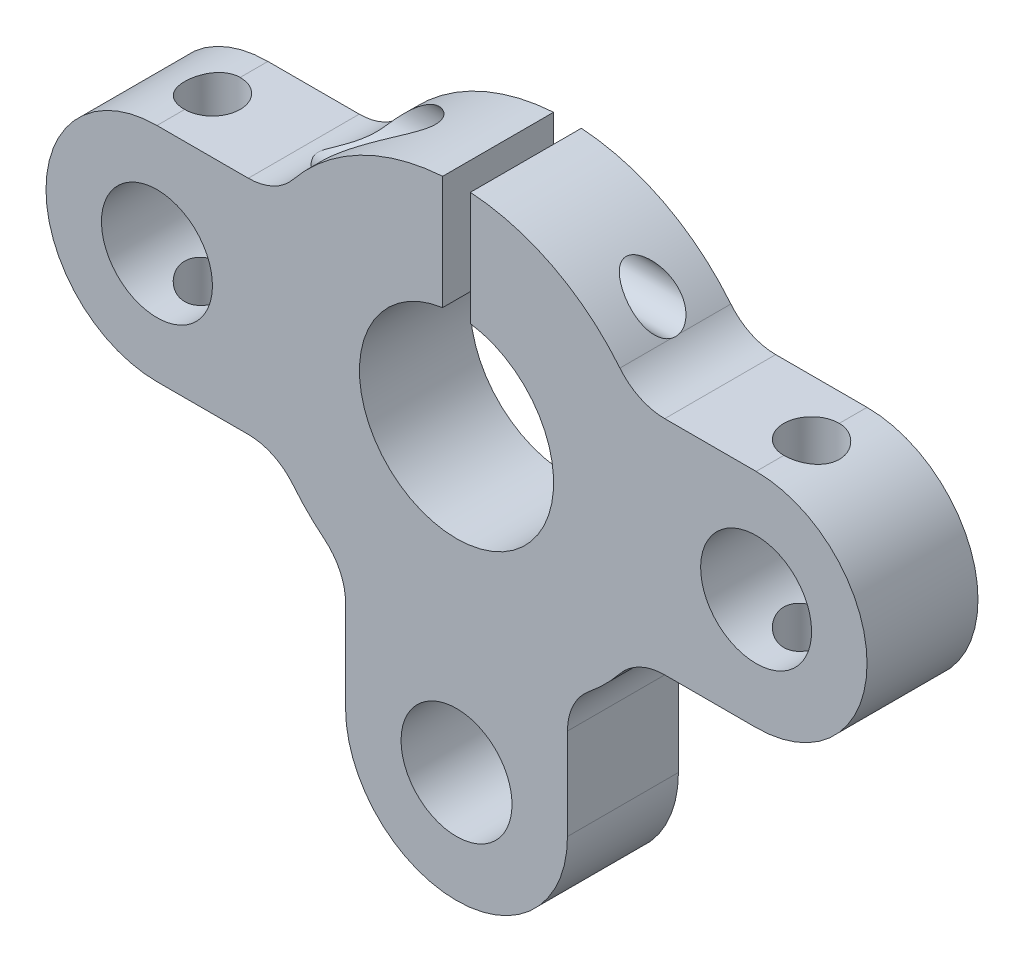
ISO-10303-21;
HEADER;
FILE_DESCRIPTION(('STEP AP214'),'2;1');
FILE_NAME('part.step','',(''),(''),'','','');
FILE_SCHEMA(('AUTOMOTIVE_DESIGN { 1 0 10303 214 1 1 1 1 }'));
ENDSEC;
DATA;
#1=APPLICATION_CONTEXT('core data for automotive mechanical design processes');
#2=APPLICATION_PROTOCOL_DEFINITION('international standard','automotive_design',2000,#1);
#3=PRODUCT_CONTEXT('',#1,'mechanical');
#4=PRODUCT('Part','Part','',(#3));
#5=PRODUCT_RELATED_PRODUCT_CATEGORY('part','',(#4));
#6=PRODUCT_DEFINITION_FORMATION('','',#4);
#7=PRODUCT_DEFINITION_CONTEXT('part definition',#1,'design');
#8=PRODUCT_DEFINITION('design','',#6,#7);
#9=PRODUCT_DEFINITION_SHAPE('','',#8);
#10=(LENGTH_UNIT() NAMED_UNIT(*) SI_UNIT(.MILLI.,.METRE.));
#11=(NAMED_UNIT(*) PLANE_ANGLE_UNIT() SI_UNIT($,.RADIAN.));
#12=(NAMED_UNIT(*) SI_UNIT($,.STERADIAN.) SOLID_ANGLE_UNIT());
#13=UNCERTAINTY_MEASURE_WITH_UNIT(LENGTH_MEASURE(1.E-05),#10,'distance_accuracy_value','');
#14=(GEOMETRIC_REPRESENTATION_CONTEXT(3) GLOBAL_UNCERTAINTY_ASSIGNED_CONTEXT((#13)) GLOBAL_UNIT_ASSIGNED_CONTEXT((#10,
#11,#12)) REPRESENTATION_CONTEXT('',''));
#15=CARTESIAN_POINT('',(0.,0.,0.));
#16=DIRECTION('',(0.,0.,1.));
#17=DIRECTION('',(1.,0.,0.));
#18=AXIS2_PLACEMENT_3D('',#15,#16,#17);
#19=CARTESIAN_POINT('',(0.,0.,12.7));
#20=DIRECTION('',(0.,0.,-1.));
#21=DIRECTION('',(-1.,0.,0.));
#22=AXIS2_PLACEMENT_3D('',#19,#20,#21);
#23=CYLINDRICAL_SURFACE('',#22,24.0665);
#24=CARTESIAN_POINT('',(0.,0.,12.7));
#25=DIRECTION('',(0.,0.,1.));
#26=DIRECTION('',(1.,0.,0.));
#27=AXIS2_PLACEMENT_3D('',#24,#25,#26);
#28=CIRCLE('',#27,24.0665);
#29=CARTESIAN_POINT('',(-18.701639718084,-15.1474451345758,12.7));
#30=VERTEX_POINT('',#29);
#31=CARTESIAN_POINT('',(-15.1474451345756,-18.7016397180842,12.7));
#32=VERTEX_POINT('',#31);
#33=EDGE_CURVE('E479',#30,#32,#28,.T.);
#34=ORIENTED_EDGE('',*,*,#33,.F.);
#35=DIRECTION('',(0.,0.,-1.));
#36=VECTOR('',#35,1.);
#37=CARTESIAN_POINT('',(-18.701639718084,-15.1474451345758,12.7));
#38=LINE('',#37,#36);
#39=CARTESIAN_POINT('',(-18.701639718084,-15.1474451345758,0.));
#40=VERTEX_POINT('',#39);
#41=EDGE_CURVE('E268',#30,#40,#38,.T.);
#42=ORIENTED_EDGE('',*,*,#41,.T.);
#43=CARTESIAN_POINT('',(0.,0.,0.));
#44=DIRECTION('',(0.,0.,1.));
#45=DIRECTION('',(1.,0.,0.));
#46=AXIS2_PLACEMENT_3D('',#43,#44,#45);
#47=CIRCLE('',#46,24.0665);
#48=CARTESIAN_POINT('',(-15.1474451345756,-18.7016397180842,0.));
#49=VERTEX_POINT('',#48);
#50=EDGE_CURVE('E386',#40,#49,#47,.T.);
#51=ORIENTED_EDGE('',*,*,#50,.T.);
#52=DIRECTION('',(0.,0.,-1.));
#53=VECTOR('',#52,1.);
#54=CARTESIAN_POINT('',(-15.1474451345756,-18.7016397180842,12.7));
#55=LINE('',#54,#53);
#56=EDGE_CURVE('E266',#49,#32,#55,.F.);
#57=ORIENTED_EDGE('',*,*,#56,.T.);
#58=EDGE_LOOP('',(#34,#42,#51,#57));
#59=FACE_BOUND('',#58,.T.);
#60=ADVANCED_FACE('F37',(#59),#23,.T.);
#61=DIRECTION('',(0.,0.,-1.));
#62=VECTOR('',#61,1.);
#63=CARTESIAN_POINT('',(18.7016397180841,15.1474451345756,12.7));
#64=LINE('',#63,#62);
#65=CARTESIAN_POINT('',(18.7016397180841,15.1474451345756,12.7));
#66=VERTEX_POINT('',#65);
#67=CARTESIAN_POINT('',(18.7016397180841,15.1474451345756,6.77755394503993));
#68=VERTEX_POINT('',#67);
#69=EDGE_CURVE('E251',#66,#68,#64,.T.);
#70=ORIENTED_EDGE('',*,*,#69,.T.);
#71=CARTESIAN_POINT('',(18.7016397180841,15.1474451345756,6.77755394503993));
#72=CARTESIAN_POINT('',(18.6929412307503,15.1581820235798,6.84083116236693));
#73=CARTESIAN_POINT('',(18.6823166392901,15.1712832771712,6.90342031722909));
#74=CARTESIAN_POINT('',(18.6574139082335,15.201899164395,7.02670675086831));
#75=CARTESIAN_POINT('',(18.6431390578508,15.2194098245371,7.08740567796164));
#76=CARTESIAN_POINT('',(18.6112409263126,15.2583994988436,7.20605459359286));
#77=CARTESIAN_POINT('',(18.5936441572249,15.2798470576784,7.26402209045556));
#78=CARTESIAN_POINT('',(18.5552586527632,15.3264383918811,7.37734864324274));
#79=CARTESIAN_POINT('',(18.5344692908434,15.3515828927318,7.43270718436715));
#80=CARTESIAN_POINT('',(18.4678124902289,15.4318218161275,7.59404169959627));
#81=CARTESIAN_POINT('',(18.4175157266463,15.4918950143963,7.69579021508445));
#82=CARTESIAN_POINT('',(18.306981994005,15.6223614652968,7.88657801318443));
#83=CARTESIAN_POINT('',(18.2467239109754,15.6927766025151,7.97558953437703));
#84=CARTESIAN_POINT('',(18.0918045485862,15.8714207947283,8.17399704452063));
#85=CARTESIAN_POINT('',(17.9931273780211,15.9833699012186,8.27692879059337));
#86=CARTESIAN_POINT('',(17.7837459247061,16.2160249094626,8.45740863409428));
#87=CARTESIAN_POINT('',(17.6730223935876,16.3367447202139,8.53491528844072));
#88=CARTESIAN_POINT('',(17.402359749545,16.6254550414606,8.68942777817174));
#89=CARTESIAN_POINT('',(17.2387698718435,16.7951875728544,8.75674238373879));
#90=CARTESIAN_POINT('',(16.901102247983,17.1349586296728,8.85351629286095));
#91=CARTESIAN_POINT('',(16.7270096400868,17.3049972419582,8.88292057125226));
#92=CARTESIAN_POINT('',(16.4355524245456,17.5810677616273,8.90365422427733));
#93=CARTESIAN_POINT('',(16.319976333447,17.6884040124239,8.90479115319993));
#94=CARTESIAN_POINT('',(16.0870252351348,17.9005259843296,8.89394527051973));
#95=CARTESIAN_POINT('',(15.9696496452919,18.0053108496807,8.88195811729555));
#96=CARTESIAN_POINT('',(15.7338385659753,18.2117365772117,8.84546718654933));
#97=CARTESIAN_POINT('',(15.6154019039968,18.313373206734,8.82094727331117));
#98=CARTESIAN_POINT('',(15.3784639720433,18.5127855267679,8.75974298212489));
#99=CARTESIAN_POINT('',(15.2599627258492,18.6105621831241,8.72306166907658));
#100=CARTESIAN_POINT('',(15.0413021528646,18.7875599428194,8.64391233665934));
#101=CARTESIAN_POINT('',(14.941026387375,18.8673840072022,8.60310671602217));
#102=CARTESIAN_POINT('',(14.7417403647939,19.0234994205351,8.51250268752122));
#103=CARTESIAN_POINT('',(14.6427303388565,19.099790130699,8.46270266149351));
#104=CARTESIAN_POINT('',(14.4471463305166,19.248153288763,8.35385835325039));
#105=CARTESIAN_POINT('',(14.3505662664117,19.3202370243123,8.29484053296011));
#106=CARTESIAN_POINT('',(14.1608014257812,19.4597526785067,8.16681420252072));
#107=CARTESIAN_POINT('',(14.067614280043,19.5271878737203,8.09781283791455));
#108=CARTESIAN_POINT('',(13.8841435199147,19.6580763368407,7.94702427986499));
#109=CARTESIAN_POINT('',(13.7939799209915,19.7213984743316,7.86497430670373));
#110=CARTESIAN_POINT('',(13.621770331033,19.8407340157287,7.68786049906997));
#111=CARTESIAN_POINT('',(13.5397201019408,19.8967512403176,7.59280352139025));
#112=CARTESIAN_POINT('',(13.403310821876,19.9888236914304,7.40843071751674));
#113=CARTESIAN_POINT('',(13.3466847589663,20.0266356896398,7.3216990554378));
#114=CARTESIAN_POINT('',(13.2452314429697,20.0938787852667,7.13856763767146));
#115=CARTESIAN_POINT('',(13.2003809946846,20.123326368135,7.04218741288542));
#116=CARTESIAN_POINT('',(13.1359586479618,20.1654190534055,6.86547115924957));
#117=CARTESIAN_POINT('',(13.1128858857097,20.1804130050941,6.78698732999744));
#118=CARTESIAN_POINT('',(13.0779820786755,20.2030504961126,6.62653324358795));
#119=CARTESIAN_POINT('',(13.066139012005,20.2107018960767,6.54456681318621));
#120=CARTESIAN_POINT('',(13.0548950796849,20.2179669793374,6.37907394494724));
#121=CARTESIAN_POINT('',(13.0555440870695,20.2175484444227,6.29554258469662));
#122=CARTESIAN_POINT('',(13.0693351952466,20.2086357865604,6.12994911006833));
#123=CARTESIAN_POINT('',(13.0824836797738,20.2001375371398,6.04788776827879));
#124=CARTESIAN_POINT('',(13.1190091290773,20.1764332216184,5.89134489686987));
#125=CARTESIAN_POINT('',(13.1418733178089,20.1615631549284,5.81668843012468));
#126=CARTESIAN_POINT('',(13.1959541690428,20.126208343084,5.67192516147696));
#127=CARTESIAN_POINT('',(13.2271739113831,20.1057215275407,5.60182004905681));
#128=CARTESIAN_POINT('',(13.3198127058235,20.0445455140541,5.42042379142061));
#129=CARTESIAN_POINT('',(13.3873012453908,19.999610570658,5.31367502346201));
#130=CARTESIAN_POINT('',(13.5345073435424,19.9002880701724,5.11379288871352));
#131=CARTESIAN_POINT('',(13.614265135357,19.8458693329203,5.02070635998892));
#132=CARTESIAN_POINT('',(13.7674315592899,19.7398435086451,4.86171369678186));
#133=CARTESIAN_POINT('',(13.8396231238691,19.6893246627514,4.79387526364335));
#134=CARTESIAN_POINT('',(13.9878977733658,19.5842640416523,4.66594320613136));
#135=CARTESIAN_POINT('',(14.0639833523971,19.5297196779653,4.6058546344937));
#136=CARTESIAN_POINT('',(14.2189654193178,19.4171736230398,4.49276408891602));
#137=CARTESIAN_POINT('',(14.2978650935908,19.3591679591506,4.43977049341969));
#138=CARTESIAN_POINT('',(14.4576028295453,19.2401682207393,4.34046196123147));
#139=CARTESIAN_POINT('',(14.5384414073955,19.1791733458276,4.29414882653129));
#140=CARTESIAN_POINT('',(14.7370700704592,19.0272673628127,4.18900790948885));
#141=CARTESIAN_POINT('',(14.8555685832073,18.9349321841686,4.1335570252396));
#142=CARTESIAN_POINT('',(15.0939585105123,18.7454541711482,4.03519756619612));
#143=CARTESIAN_POINT('',(15.2138504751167,18.6483093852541,3.99229413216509));
#144=CARTESIAN_POINT('',(15.4541292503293,18.4496785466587,3.91888014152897));
#145=CARTESIAN_POINT('',(15.5745165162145,18.3481866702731,3.88838682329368));
#146=CARTESIAN_POINT('',(15.8146976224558,18.1415779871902,3.84011382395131));
#147=CARTESIAN_POINT('',(15.9344915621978,18.0364618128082,3.82233193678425));
#148=CARTESIAN_POINT('',(16.1735788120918,17.822393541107,3.79992423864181));
#149=CARTESIAN_POINT('',(16.2928609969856,17.7134179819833,3.79540174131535));
#150=CARTESIAN_POINT('',(16.5290878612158,17.493191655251,3.80064563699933));
#151=CARTESIAN_POINT('',(16.6460318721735,17.3819402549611,3.81041605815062));
#152=CARTESIAN_POINT('',(16.8761278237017,17.1586228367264,3.8453014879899));
#153=CARTESIAN_POINT('',(16.9892909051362,17.0465606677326,3.87036625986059));
#154=CARTESIAN_POINT('',(17.2108693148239,16.8228167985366,3.93708481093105));
#155=CARTESIAN_POINT('',(17.3192888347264,16.7111348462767,3.97872360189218));
#156=CARTESIAN_POINT('',(17.5428184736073,16.4765058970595,4.08625025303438));
#157=CARTESIAN_POINT('',(17.6571315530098,16.3538464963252,4.15447644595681));
#158=CARTESIAN_POINT('',(17.8750027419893,16.1154177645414,4.31565709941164));
#159=CARTESIAN_POINT('',(17.9785758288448,15.9996389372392,4.40857646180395));
#160=CARTESIAN_POINT('',(18.1530091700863,15.8012256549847,4.60034468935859));
#161=CARTESIAN_POINT('',(18.2263476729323,15.7164704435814,4.69472376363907));
#162=CARTESIAN_POINT('',(18.361112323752,15.5588146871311,4.90056407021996));
#163=CARTESIAN_POINT('',(18.4225448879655,15.4859077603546,5.01201604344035));
#164=CARTESIAN_POINT('',(18.5220080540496,15.3667398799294,5.23130363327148));
#165=CARTESIAN_POINT('',(18.5622119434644,15.3180805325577,5.33685046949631));
#166=CARTESIAN_POINT('',(18.630554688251,15.2348865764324,5.55689598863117));
#167=CARTESIAN_POINT('',(18.6587267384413,15.2003131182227,5.6713689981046));
#168=CARTESIAN_POINT('',(18.684261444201,15.1688771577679,5.81080070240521));
#169=CARTESIAN_POINT('',(18.6880722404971,15.1641817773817,5.8330065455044));
#170=CARTESIAN_POINT('',(18.6952147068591,15.1553753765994,5.87759379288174));
#171=CARTESIAN_POINT('',(18.6985467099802,15.15126395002,5.89997506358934));
#172=CARTESIAN_POINT('',(18.7016397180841,15.1474451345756,5.92244605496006));
#173=B_SPLINE_CURVE_WITH_KNOTS('',3,(#71,#72,#73,#74,#75,#76,#77,#78,#79,#80,#81,#82,#83,#84,
#85,#86,#87,#88,#89,#90,#91,#92,#93,#94,#95,#96,#97,#98,#99,#100,#101,#102,#103,#104,#105,#106,
#107,#108,#109,#110,#111,#112,#113,#114,#115,#116,#117,#118,#119,#120,#121,#122,#123,#124,#125,
#126,#127,#128,#129,#130,#131,#132,#133,#134,#135,#136,#137,#138,#139,#140,#141,#142,#143,#144,
#145,#146,#147,#148,#149,#150,#151,#152,#153,#154,#155,#156,#157,#158,#159,#160,#161,#162,#163,
#164,#165,#166,#167,#168,#169,#170,#171,#172),.UNSPECIFIED.,.F.,.F.,(4,2,2,2,2,2,2,2,2,2,2,2,2,
2,2,2,2,2,2,2,2,2,2,2,2,2,2,2,2,2,2,2,2,2,2,2,2,2,2,2,2,2,2,2,2,2,2,2,2,2,4),(0.,
0.194198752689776,0.388223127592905,0.580759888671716,0.773334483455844,1.15682464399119,
1.54113832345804,2.08198607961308,2.6237110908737,3.35525124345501,4.08785200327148,
4.56052267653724,5.03334976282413,5.50678714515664,5.98010530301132,6.38330134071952,
6.78656998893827,7.18870154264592,7.59054668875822,8.00185283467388,8.41294298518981,
8.74271079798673,9.07182408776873,9.32032779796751,9.56856517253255,9.81779380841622,
10.0671497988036,10.3047209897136,10.5423798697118,10.9422254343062,11.3434112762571,
11.6765614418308,12.0099277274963,12.3436842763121,12.6775306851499,13.1572849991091,
13.637235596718,14.117850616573,14.5983822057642,15.0826481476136,15.5670505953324,
16.0498704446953,16.5322546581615,17.0734794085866,17.6139389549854,18.0518581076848,
18.4895406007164,18.856999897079,19.2234387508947,19.292476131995,19.3614652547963),.UNSPECIFIED.);
#174=CARTESIAN_POINT('',(18.7016397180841,15.1474451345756,5.92244605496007));
#175=VERTEX_POINT('',#174);
#176=EDGE_CURVE('E51',#68,#175,#173,.T.);
#177=ORIENTED_EDGE('',*,*,#176,.T.);
#178=CARTESIAN_POINT('',(18.7016397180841,15.1474451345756,0.));
#179=VERTEX_POINT('',#178);
#180=EDGE_CURVE('E245',#175,#179,#64,.T.);
#181=ORIENTED_EDGE('',*,*,#180,.T.);
#182=CARTESIAN_POINT('',(1.5875,24.0140847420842,0.));
#183=VERTEX_POINT('',#182);
#184=EDGE_CURVE('E387',#179,#183,#47,.T.);
#185=ORIENTED_EDGE('',*,*,#184,.T.);
#186=DIRECTION('',(0.,0.,-1.));
#187=VECTOR('',#186,1.);
#188=CARTESIAN_POINT('',(1.5875,24.0140847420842,12.7));
#189=LINE('',#188,#187);
#190=CARTESIAN_POINT('',(1.5875,24.0140847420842,12.7));
#191=VERTEX_POINT('',#190);
#192=EDGE_CURVE('E468',#183,#191,#189,.F.);
#193=ORIENTED_EDGE('',*,*,#192,.T.);
#194=EDGE_CURVE('E480',#66,#191,#28,.T.);
#195=ORIENTED_EDGE('',*,*,#194,.F.);
#196=EDGE_LOOP('',(#70,#177,#181,#185,#193,#195));
#197=FACE_BOUND('',#196,.T.);
#198=ADVANCED_FACE('F352',(#197),#23,.T.);
#199=CARTESIAN_POINT('',(15.1474451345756,-18.7016397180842,0.));
#200=VERTEX_POINT('',#199);
#201=CARTESIAN_POINT('',(18.7016397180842,-15.1474451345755,0.));
#202=VERTEX_POINT('',#201);
#203=EDGE_CURVE('E381',#200,#202,#47,.T.);
#204=ORIENTED_EDGE('',*,*,#203,.T.);
#205=DIRECTION('',(0.,0.,-1.));
#206=VECTOR('',#205,1.);
#207=CARTESIAN_POINT('',(18.7016397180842,-15.1474451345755,12.7));
#208=LINE('',#207,#206);
#209=CARTESIAN_POINT('',(18.7016397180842,-15.1474451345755,12.7));
#210=VERTEX_POINT('',#209);
#211=EDGE_CURVE('E262',#202,#210,#208,.F.);
#212=ORIENTED_EDGE('',*,*,#211,.T.);
#213=CARTESIAN_POINT('',(15.1474451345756,-18.7016397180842,12.7));
#214=VERTEX_POINT('',#213);
#215=EDGE_CURVE('E398',#214,#210,#28,.T.);
#216=ORIENTED_EDGE('',*,*,#215,.F.);
#217=DIRECTION('',(0.,0.,-1.));
#218=VECTOR('',#217,1.);
#219=CARTESIAN_POINT('',(15.1474451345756,-18.7016397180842,12.7));
#220=LINE('',#219,#218);
#221=EDGE_CURVE('E259',#214,#200,#220,.T.);
#222=ORIENTED_EDGE('',*,*,#221,.T.);
#223=EDGE_LOOP('',(#204,#212,#216,#222));
#224=FACE_BOUND('',#223,.T.);
#225=ADVANCED_FACE('F357',(#224),#23,.T.);
#226=CARTESIAN_POINT('',(0.,0.,12.7));
#227=DIRECTION('',(0.,0.,1.));
#228=DIRECTION('',(1.,0.,0.));
#229=AXIS2_PLACEMENT_3D('',#226,#227,#228);
#230=PLANE('',#229);
#231=DIRECTION('',(-1.,0.,0.));
#232=VECTOR('',#231,1.);
#233=CARTESIAN_POINT('',(-34.2899999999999,-12.7000000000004,12.7));
#234=LINE('',#233,#232);
#235=CARTESIAN_POINT('',(-23.8334880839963,-12.7000000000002,12.7));
#236=VERTEX_POINT('',#235);
#237=CARTESIAN_POINT('',(-34.2899999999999,-12.7000000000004,12.7));
#238=VERTEX_POINT('',#237);
#239=EDGE_CURVE('E578',#236,#238,#234,.T.);
#240=ORIENTED_EDGE('',*,*,#239,.F.);
#241=CARTESIAN_POINT('',(-23.8334880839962,-19.3040000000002,12.7));
#242=DIRECTION('',(0.,0.,1.));
#243=DIRECTION('',(1.,0.,0.));
#244=AXIS2_PLACEMENT_3D('',#241,#242,#243);
#245=CIRCLE('',#244,6.604);
#246=EDGE_CURVE('E293',#236,#30,#245,.F.);
#247=ORIENTED_EDGE('',*,*,#246,.T.);
#248=ORIENTED_EDGE('',*,*,#33,.T.);
#249=CARTESIAN_POINT('',(-19.304,-23.8334880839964,12.7));
#250=DIRECTION('',(0.,0.,1.));
#251=DIRECTION('',(1.,0.,0.));
#252=AXIS2_PLACEMENT_3D('',#249,#250,#251);
#253=CIRCLE('',#252,6.604);
#254=CARTESIAN_POINT('',(-12.7,-23.8334880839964,12.7));
#255=VERTEX_POINT('',#254);
#256=EDGE_CURVE('E297',#32,#255,#253,.F.);
#257=ORIENTED_EDGE('',*,*,#256,.T.);
#258=DIRECTION('',(0.,1.,0.));
#259=VECTOR('',#258,1.);
#260=CARTESIAN_POINT('',(-12.7,-34.29,12.7));
#261=LINE('',#260,#259);
#262=CARTESIAN_POINT('',(-12.7,-34.29,12.7));
#263=VERTEX_POINT('',#262);
#264=EDGE_CURVE('E437',#263,#255,#261,.T.);
#265=ORIENTED_EDGE('',*,*,#264,.F.);
#266=CARTESIAN_POINT('',(0.,-34.29,12.7));
#267=DIRECTION('',(0.,0.,-1.));
#268=DIRECTION('',(-1.,0.,0.));
#269=AXIS2_PLACEMENT_3D('',#266,#267,#268);
#270=CIRCLE('',#269,12.7);
#271=CARTESIAN_POINT('',(12.7,-34.29,12.7));
#272=VERTEX_POINT('',#271);
#273=EDGE_CURVE('E434',#272,#263,#270,.T.);
#274=ORIENTED_EDGE('',*,*,#273,.F.);
#275=DIRECTION('',(0.,-1.,0.));
#276=VECTOR('',#275,1.);
#277=CARTESIAN_POINT('',(12.7,-34.29,12.7));
#278=LINE('',#277,#276);
#279=CARTESIAN_POINT('',(12.7,-23.8334880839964,12.7));
#280=VERTEX_POINT('',#279);
#281=EDGE_CURVE('E441',#280,#272,#278,.T.);
#282=ORIENTED_EDGE('',*,*,#281,.F.);
#283=CARTESIAN_POINT('',(19.304,-23.8334880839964,12.7));
#284=DIRECTION('',(0.,0.,1.));
#285=DIRECTION('',(1.,0.,0.));
#286=AXIS2_PLACEMENT_3D('',#283,#284,#285);
#287=CIRCLE('',#286,6.604);
#288=EDGE_CURVE('E289',#280,#214,#287,.F.);
#289=ORIENTED_EDGE('',*,*,#288,.T.);
#290=ORIENTED_EDGE('',*,*,#215,.T.);
#291=CARTESIAN_POINT('',(23.8334880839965,-19.3039999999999,12.7));
#292=DIRECTION('',(0.,0.,1.));
#293=DIRECTION('',(1.,0.,0.));
#294=AXIS2_PLACEMENT_3D('',#291,#292,#293);
#295=CIRCLE('',#294,6.604);
#296=CARTESIAN_POINT('',(23.8334880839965,-12.6999999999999,12.7));
#297=VERTEX_POINT('',#296);
#298=EDGE_CURVE('E285',#210,#297,#295,.F.);
#299=ORIENTED_EDGE('',*,*,#298,.T.);
#300=DIRECTION('',(-1.,0.,0.));
#301=VECTOR('',#300,1.);
#302=CARTESIAN_POINT('',(34.29,-12.6999999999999,12.7));
#303=LINE('',#302,#301);
#304=CARTESIAN_POINT('',(34.29,-12.6999999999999,12.7));
#305=VERTEX_POINT('',#304);
#306=EDGE_CURVE('E396',#305,#297,#303,.T.);
#307=ORIENTED_EDGE('',*,*,#306,.F.);
#308=CARTESIAN_POINT('',(34.29,1.19722895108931E-13,12.7));
#309=DIRECTION('',(0.,0.,-1.));
#310=DIRECTION('',(0.,-1.,0.));
#311=AXIS2_PLACEMENT_3D('',#308,#309,#310);
#312=CIRCLE('',#311,12.7);
#313=CARTESIAN_POINT('',(34.29,12.7000000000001,12.7));
#314=VERTEX_POINT('',#313);
#315=EDGE_CURVE('E407',#314,#305,#312,.T.);
#316=ORIENTED_EDGE('',*,*,#315,.F.);
#317=DIRECTION('',(1.,0.,0.));
#318=VECTOR('',#317,1.);
#319=CARTESIAN_POINT('',(34.29,12.7000000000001,12.7));
#320=LINE('',#319,#318);
#321=CARTESIAN_POINT('',(23.8334880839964,12.7000000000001,12.7));
#322=VERTEX_POINT('',#321);
#323=EDGE_CURVE('E406',#322,#314,#320,.T.);
#324=ORIENTED_EDGE('',*,*,#323,.F.);
#325=CARTESIAN_POINT('',(23.8334880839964,19.3040000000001,12.7));
#326=DIRECTION('',(0.,0.,1.));
#327=DIRECTION('',(1.,0.,0.));
#328=AXIS2_PLACEMENT_3D('',#325,#326,#327);
#329=CIRCLE('',#328,6.604);
#330=EDGE_CURVE('E281',#322,#66,#329,.F.);
#331=ORIENTED_EDGE('',*,*,#330,.T.);
#332=ORIENTED_EDGE('',*,*,#194,.T.);
#333=DIRECTION('',(0.,1.,0.));
#334=VECTOR('',#333,1.);
#335=CARTESIAN_POINT('',(1.5875,0.,12.7));
#336=LINE('',#335,#334);
#337=CARTESIAN_POINT('',(1.5875,10.9985226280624,12.7));
#338=VERTEX_POINT('',#337);
#339=EDGE_CURVE('E453',#338,#191,#336,.T.);
#340=ORIENTED_EDGE('',*,*,#339,.F.);
#341=CARTESIAN_POINT('',(0.,0.,12.7));
#342=DIRECTION('',(0.,0.,1.));
#343=DIRECTION('',(1.,0.,0.));
#344=AXIS2_PLACEMENT_3D('',#341,#342,#343);
#345=CIRCLE('',#344,11.1125);
#346=CARTESIAN_POINT('',(-1.5875,10.9985226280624,12.7));
#347=VERTEX_POINT('',#346);
#348=EDGE_CURVE('E472',#347,#338,#345,.T.);
#349=ORIENTED_EDGE('',*,*,#348,.F.);
#350=DIRECTION('',(0.,-1.,0.));
#351=VECTOR('',#350,1.);
#352=CARTESIAN_POINT('',(-1.5875,0.,12.7));
#353=LINE('',#352,#351);
#354=CARTESIAN_POINT('',(-1.5875,24.0140847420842,12.7));
#355=VERTEX_POINT('',#354);
#356=EDGE_CURVE('E459',#355,#347,#353,.T.);
#357=ORIENTED_EDGE('',*,*,#356,.F.);
#358=CARTESIAN_POINT('',(-18.7016397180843,15.1474451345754,12.7));
#359=VERTEX_POINT('',#358);
#360=EDGE_CURVE('E477',#355,#359,#28,.T.);
#361=ORIENTED_EDGE('',*,*,#360,.T.);
#362=CARTESIAN_POINT('',(-23.8334880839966,19.3039999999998,12.7));
#363=DIRECTION('',(0.,0.,1.));
#364=DIRECTION('',(1.,0.,0.));
#365=AXIS2_PLACEMENT_3D('',#362,#363,#364);
#366=CIRCLE('',#365,6.604);
#367=CARTESIAN_POINT('',(-23.8334880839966,12.6999999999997,12.7));
#368=VERTEX_POINT('',#367);
#369=EDGE_CURVE('E242',#359,#368,#366,.F.);
#370=ORIENTED_EDGE('',*,*,#369,.T.);
#371=DIRECTION('',(1.,0.,0.));
#372=VECTOR('',#371,1.);
#373=CARTESIAN_POINT('',(-34.2900000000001,12.6999999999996,12.7));
#374=LINE('',#373,#372);
#375=CARTESIAN_POINT('',(-34.2900000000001,12.6999999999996,12.7));
#376=VERTEX_POINT('',#375);
#377=EDGE_CURVE('E592',#376,#368,#374,.T.);
#378=ORIENTED_EDGE('',*,*,#377,.F.);
#379=CARTESIAN_POINT('',(-34.29,-3.59168685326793E-13,12.7));
#380=DIRECTION('',(0.,0.,-1.));
#381=DIRECTION('',(0.,1.,0.));
#382=AXIS2_PLACEMENT_3D('',#379,#380,#381);
#383=CIRCLE('',#382,12.7);
#384=EDGE_CURVE('E572',#238,#376,#383,.T.);
#385=ORIENTED_EDGE('',*,*,#384,.F.);
#386=EDGE_LOOP('',(#240,#247,#248,#257,#265,#274,#282,#289,#290,#299,#307,#316,#324,#331,#332,
#340,#349,#357,#361,#370,#378,#385));
#387=FACE_BOUND('',#386,.T.);
#388=CARTESIAN_POINT('',(34.29,1.19722895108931E-13,12.7));
#389=DIRECTION('',(0.,0.,-1.));
#390=DIRECTION('',(0.,-1.,0.));
#391=AXIS2_PLACEMENT_3D('',#388,#389,#390);
#392=CIRCLE('',#391,6.35);
#393=CARTESIAN_POINT('',(34.29,-6.34999999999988,12.7));
#394=VERTEX_POINT('',#393);
#395=EDGE_CURVE('E419',#394,#394,#392,.T.);
#396=ORIENTED_EDGE('',*,*,#395,.T.);
#397=EDGE_LOOP('',(#396));
#398=FACE_BOUND('',#397,.T.);
#399=CARTESIAN_POINT('',(-34.29,-3.59168685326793E-13,12.7));
#400=DIRECTION('',(0.,0.,-1.));
#401=DIRECTION('',(0.,1.,0.));
#402=AXIS2_PLACEMENT_3D('',#399,#400,#401);
#403=CIRCLE('',#402,6.35);
#404=CARTESIAN_POINT('',(-34.2900000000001,6.34999999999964,12.7));
#405=VERTEX_POINT('',#404);
#406=EDGE_CURVE('E605',#405,#405,#403,.T.);
#407=ORIENTED_EDGE('',*,*,#406,.T.);
#408=EDGE_LOOP('',(#407));
#409=FACE_BOUND('',#408,.T.);
#410=CARTESIAN_POINT('',(0.,-34.29,12.7));
#411=DIRECTION('',(0.,0.,-1.));
#412=DIRECTION('',(-1.,0.,0.));
#413=AXIS2_PLACEMENT_3D('',#410,#411,#412);
#414=CIRCLE('',#413,6.35);
#415=CARTESIAN_POINT('',(-6.35,-34.29,12.7));
#416=VERTEX_POINT('',#415);
#417=EDGE_CURVE('E428',#416,#416,#414,.T.);
#418=ORIENTED_EDGE('',*,*,#417,.T.);
#419=EDGE_LOOP('',(#418));
#420=FACE_BOUND('',#419,.T.);
#421=ADVANCED_FACE('F370',(#387,#398,#409,#420),#230,.T.);
#422=CARTESIAN_POINT('',(0.,0.,0.));
#423=DIRECTION('',(0.,0.,1.));
#424=DIRECTION('',(1.,0.,0.));
#425=AXIS2_PLACEMENT_3D('',#422,#423,#424);
#426=PLANE('',#425);
#427=ORIENTED_EDGE('',*,*,#203,.F.);
#428=CARTESIAN_POINT('',(19.304,-23.8334880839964,0.));
#429=DIRECTION('',(0.,0.,1.));
#430=DIRECTION('',(1.,0.,0.));
#431=AXIS2_PLACEMENT_3D('',#428,#429,#430);
#432=CIRCLE('',#431,6.604);
#433=CARTESIAN_POINT('',(12.7,-23.8334880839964,0.));
#434=VERTEX_POINT('',#433);
#435=EDGE_CURVE('E287',#200,#434,#432,.T.);
#436=ORIENTED_EDGE('',*,*,#435,.T.);
#437=DIRECTION('',(0.,-1.,0.));
#438=VECTOR('',#437,1.);
#439=CARTESIAN_POINT('',(12.7,-34.29,0.));
#440=LINE('',#439,#438);
#441=CARTESIAN_POINT('',(12.7,-34.29,0.));
#442=VERTEX_POINT('',#441);
#443=EDGE_CURVE('E438',#434,#442,#440,.T.);
#444=ORIENTED_EDGE('',*,*,#443,.T.);
#445=CARTESIAN_POINT('',(0.,-34.29,0.));
#446=DIRECTION('',(0.,0.,-1.));
#447=DIRECTION('',(-1.,0.,0.));
#448=AXIS2_PLACEMENT_3D('',#445,#446,#447);
#449=CIRCLE('',#448,12.7);
#450=CARTESIAN_POINT('',(-12.7,-34.29,0.));
#451=VERTEX_POINT('',#450);
#452=EDGE_CURVE('E431',#442,#451,#449,.T.);
#453=ORIENTED_EDGE('',*,*,#452,.T.);
#454=DIRECTION('',(0.,1.,0.));
#455=VECTOR('',#454,1.);
#456=CARTESIAN_POINT('',(-12.7,-34.29,0.));
#457=LINE('',#456,#455);
#458=CARTESIAN_POINT('',(-12.7,-23.8334880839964,0.));
#459=VERTEX_POINT('',#458);
#460=EDGE_CURVE('E446',#451,#459,#457,.T.);
#461=ORIENTED_EDGE('',*,*,#460,.T.);
#462=CARTESIAN_POINT('',(-19.304,-23.8334880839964,0.));
#463=DIRECTION('',(0.,0.,1.));
#464=DIRECTION('',(1.,0.,0.));
#465=AXIS2_PLACEMENT_3D('',#462,#463,#464);
#466=CIRCLE('',#465,6.604);
#467=EDGE_CURVE('E295',#459,#49,#466,.T.);
#468=ORIENTED_EDGE('',*,*,#467,.T.);
#469=ORIENTED_EDGE('',*,*,#50,.F.);
#470=CARTESIAN_POINT('',(-23.8334880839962,-19.3040000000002,0.));
#471=DIRECTION('',(0.,0.,1.));
#472=DIRECTION('',(1.,0.,0.));
#473=AXIS2_PLACEMENT_3D('',#470,#471,#472);
#474=CIRCLE('',#473,6.604);
#475=CARTESIAN_POINT('',(-23.8334880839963,-12.7000000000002,0.));
#476=VERTEX_POINT('',#475);
#477=EDGE_CURVE('E291',#40,#476,#474,.T.);
#478=ORIENTED_EDGE('',*,*,#477,.T.);
#479=DIRECTION('',(-1.,0.,0.));
#480=VECTOR('',#479,1.);
#481=CARTESIAN_POINT('',(-34.2899999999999,-12.7000000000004,0.));
#482=LINE('',#481,#480);
#483=CARTESIAN_POINT('',(-34.2899999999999,-12.7000000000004,0.));
#484=VERTEX_POINT('',#483);
#485=EDGE_CURVE('E593',#476,#484,#482,.T.);
#486=ORIENTED_EDGE('',*,*,#485,.T.);
#487=CARTESIAN_POINT('',(-34.29,-3.59168685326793E-13,0.));
#488=DIRECTION('',(0.,0.,-1.));
#489=DIRECTION('',(0.,1.,0.));
#490=AXIS2_PLACEMENT_3D('',#487,#488,#489);
#491=CIRCLE('',#490,12.7);
#492=CARTESIAN_POINT('',(-34.2900000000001,12.6999999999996,0.));
#493=VERTEX_POINT('',#492);
#494=EDGE_CURVE('E602',#484,#493,#491,.T.);
#495=ORIENTED_EDGE('',*,*,#494,.T.);
#496=DIRECTION('',(1.,0.,0.));
#497=VECTOR('',#496,1.);
#498=CARTESIAN_POINT('',(-34.2900000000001,12.6999999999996,0.));
#499=LINE('',#498,#497);
#500=CARTESIAN_POINT('',(-23.8334880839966,12.6999999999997,0.));
#501=VERTEX_POINT('',#500);
#502=EDGE_CURVE('E596',#493,#501,#499,.T.);
#503=ORIENTED_EDGE('',*,*,#502,.T.);
#504=CARTESIAN_POINT('',(-23.8334880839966,19.3039999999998,0.));
#505=DIRECTION('',(0.,0.,1.));
#506=DIRECTION('',(1.,0.,0.));
#507=AXIS2_PLACEMENT_3D('',#504,#505,#506);
#508=CIRCLE('',#507,6.604);
#509=CARTESIAN_POINT('',(-18.7016397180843,15.1474451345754,0.));
#510=VERTEX_POINT('',#509);
#511=EDGE_CURVE('E276',#501,#510,#508,.T.);
#512=ORIENTED_EDGE('',*,*,#511,.T.);
#513=CARTESIAN_POINT('',(-1.5875,24.0140847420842,0.));
#514=VERTEX_POINT('',#513);
#515=EDGE_CURVE('E481',#514,#510,#47,.T.);
#516=ORIENTED_EDGE('',*,*,#515,.F.);
#517=DIRECTION('',(0.,-1.,0.));
#518=VECTOR('',#517,1.);
#519=CARTESIAN_POINT('',(-1.5875,0.,0.));
#520=LINE('',#519,#518);
#521=CARTESIAN_POINT('',(-1.5875,10.9985226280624,0.));
#522=VERTEX_POINT('',#521);
#523=EDGE_CURVE('E458',#514,#522,#520,.T.);
#524=ORIENTED_EDGE('',*,*,#523,.T.);
#525=CARTESIAN_POINT('',(0.,0.,0.));
#526=DIRECTION('',(0.,0.,1.));
#527=DIRECTION('',(1.,0.,0.));
#528=AXIS2_PLACEMENT_3D('',#525,#526,#527);
#529=CIRCLE('',#528,11.1125);
#530=CARTESIAN_POINT('',(1.5875,10.9985226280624,0.));
#531=VERTEX_POINT('',#530);
#532=EDGE_CURVE('E471',#522,#531,#529,.T.);
#533=ORIENTED_EDGE('',*,*,#532,.T.);
#534=DIRECTION('',(0.,1.,0.));
#535=VECTOR('',#534,1.);
#536=CARTESIAN_POINT('',(1.5875,0.,0.));
#537=LINE('',#536,#535);
#538=EDGE_CURVE('E455',#531,#183,#537,.T.);
#539=ORIENTED_EDGE('',*,*,#538,.T.);
#540=ORIENTED_EDGE('',*,*,#184,.F.);
#541=CARTESIAN_POINT('',(23.8334880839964,19.3040000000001,0.));
#542=DIRECTION('',(0.,0.,1.));
#543=DIRECTION('',(1.,0.,0.));
#544=AXIS2_PLACEMENT_3D('',#541,#542,#543);
#545=CIRCLE('',#544,6.604);
#546=CARTESIAN_POINT('',(23.8334880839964,12.7000000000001,0.));
#547=VERTEX_POINT('',#546);
#548=EDGE_CURVE('E279',#179,#547,#545,.T.);
#549=ORIENTED_EDGE('',*,*,#548,.T.);
#550=DIRECTION('',(1.,0.,0.));
#551=VECTOR('',#550,1.);
#552=CARTESIAN_POINT('',(34.29,12.7000000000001,0.));
#553=LINE('',#552,#551);
#554=CARTESIAN_POINT('',(34.29,12.7000000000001,0.));
#555=VERTEX_POINT('',#554);
#556=EDGE_CURVE('E411',#547,#555,#553,.T.);
#557=ORIENTED_EDGE('',*,*,#556,.T.);
#558=CARTESIAN_POINT('',(34.29,1.19722895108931E-13,0.));
#559=DIRECTION('',(0.,0.,-1.));
#560=DIRECTION('',(0.,-1.,0.));
#561=AXIS2_PLACEMENT_3D('',#558,#559,#560);
#562=CIRCLE('',#561,12.7);
#563=CARTESIAN_POINT('',(34.29,-12.6999999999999,0.));
#564=VERTEX_POINT('',#563);
#565=EDGE_CURVE('E415',#555,#564,#562,.T.);
#566=ORIENTED_EDGE('',*,*,#565,.T.);
#567=DIRECTION('',(-1.,0.,0.));
#568=VECTOR('',#567,1.);
#569=CARTESIAN_POINT('',(34.29,-12.6999999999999,0.));
#570=LINE('',#569,#568);
#571=CARTESIAN_POINT('',(23.8334880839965,-12.6999999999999,0.));
#572=VERTEX_POINT('',#571);
#573=EDGE_CURVE('E418',#564,#572,#570,.T.);
#574=ORIENTED_EDGE('',*,*,#573,.T.);
#575=CARTESIAN_POINT('',(23.8334880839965,-19.3039999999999,0.));
#576=DIRECTION('',(0.,0.,1.));
#577=DIRECTION('',(1.,0.,0.));
#578=AXIS2_PLACEMENT_3D('',#575,#576,#577);
#579=CIRCLE('',#578,6.604);
#580=EDGE_CURVE('E283',#572,#202,#579,.T.);
#581=ORIENTED_EDGE('',*,*,#580,.T.);
#582=EDGE_LOOP('',(#427,#436,#444,#453,#461,#468,#469,#478,#486,#495,#503,#512,#516,#524,#533,
#539,#540,#549,#557,#566,#574,#581));
#583=FACE_BOUND('',#582,.T.);
#584=CARTESIAN_POINT('',(34.29,1.19722895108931E-13,0.));
#585=DIRECTION('',(0.,0.,-1.));
#586=DIRECTION('',(0.,-1.,0.));
#587=AXIS2_PLACEMENT_3D('',#584,#585,#586);
#588=CIRCLE('',#587,6.35);
#589=CARTESIAN_POINT('',(34.29,-6.34999999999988,0.));
#590=VERTEX_POINT('',#589);
#591=EDGE_CURVE('E582',#590,#590,#588,.T.);
#592=ORIENTED_EDGE('',*,*,#591,.F.);
#593=EDGE_LOOP('',(#592));
#594=FACE_BOUND('',#593,.T.);
#595=CARTESIAN_POINT('',(-34.29,-3.59168685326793E-13,0.));
#596=DIRECTION('',(0.,0.,-1.));
#597=DIRECTION('',(0.,1.,0.));
#598=AXIS2_PLACEMENT_3D('',#595,#596,#597);
#599=CIRCLE('',#598,6.35);
#600=CARTESIAN_POINT('',(-34.2900000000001,6.34999999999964,0.));
#601=VERTEX_POINT('',#600);
#602=EDGE_CURVE('E598',#601,#601,#599,.T.);
#603=ORIENTED_EDGE('',*,*,#602,.F.);
#604=EDGE_LOOP('',(#603));
#605=FACE_BOUND('',#604,.T.);
#606=CARTESIAN_POINT('',(0.,-34.29,0.));
#607=DIRECTION('',(0.,0.,-1.));
#608=DIRECTION('',(-1.,0.,0.));
#609=AXIS2_PLACEMENT_3D('',#606,#607,#608);
#610=CIRCLE('',#609,6.35);
#611=CARTESIAN_POINT('',(-6.35,-34.29,0.));
#612=VERTEX_POINT('',#611);
#613=EDGE_CURVE('E425',#612,#612,#610,.T.);
#614=ORIENTED_EDGE('',*,*,#613,.F.);
#615=EDGE_LOOP('',(#614));
#616=FACE_BOUND('',#615,.T.);
#617=ADVANCED_FACE('F362',(#583,#594,#605,#616),#426,.F.);
#618=DIRECTION('',(0.,0.,-1.));
#619=VECTOR('',#618,1.);
#620=CARTESIAN_POINT('',(-18.7016397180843,15.1474451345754,12.7));
#621=LINE('',#620,#619);
#622=CARTESIAN_POINT('',(-18.7016397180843,15.1474451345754,2.30674248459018));
#623=VERTEX_POINT('',#622);
#624=EDGE_CURVE('E235',#510,#623,#621,.F.);
#625=ORIENTED_EDGE('',*,*,#624,.T.);
#626=CARTESIAN_POINT('',(-18.7016397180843,15.1474451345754,2.30674248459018));
#627=CARTESIAN_POINT('',(-18.5859368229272,15.2903495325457,2.2178067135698));
#628=CARTESIAN_POINT('',(-18.4658465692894,15.4352197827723,2.1381276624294));
#629=CARTESIAN_POINT('',(-18.2182172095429,15.7266985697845,1.99636146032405));
#630=CARTESIAN_POINT('',(-18.0906921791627,15.8733034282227,1.93424229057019));
#631=CARTESIAN_POINT('',(-17.8305109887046,16.164999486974,1.8269431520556));
#632=CARTESIAN_POINT('',(-17.6979258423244,16.3100897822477,1.78158605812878));
#633=CARTESIAN_POINT('',(-17.4271856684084,16.5990613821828,1.70570666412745));
#634=CARTESIAN_POINT('',(-17.2890273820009,16.7429419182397,1.67519318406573));
#635=CARTESIAN_POINT('',(-16.9632893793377,17.0737480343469,1.62038357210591));
#636=CARTESIAN_POINT('',(-16.7739701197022,17.2598054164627,1.60115376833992));
#637=CARTESIAN_POINT('',(-16.3887882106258,17.6259674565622,1.58412551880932));
#638=CARTESIAN_POINT('',(-16.1929244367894,17.8060710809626,1.58633077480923));
#639=CARTESIAN_POINT('',(-15.7947728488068,18.1602035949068,1.61006738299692));
#640=CARTESIAN_POINT('',(-15.5924525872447,18.334187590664,1.63171918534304));
#641=CARTESIAN_POINT('',(-15.1837645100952,18.6740567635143,1.69262225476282));
#642=CARTESIAN_POINT('',(-14.977396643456,18.8399418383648,1.73187374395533));
#643=CARTESIAN_POINT('',(-14.4953120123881,19.2146523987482,1.84150966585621));
#644=CARTESIAN_POINT('',(-14.2184654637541,19.4203030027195,1.91783048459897));
#645=CARTESIAN_POINT('',(-13.6616521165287,19.8159650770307,2.09583597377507));
#646=CARTESIAN_POINT('',(-13.3816837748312,20.0059683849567,2.19753377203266));
#647=CARTESIAN_POINT('',(-12.8219066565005,20.3692410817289,2.42453254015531));
#648=CARTESIAN_POINT('',(-12.5421005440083,20.5425649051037,2.54975249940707));
#649=CARTESIAN_POINT('',(-12.1240783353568,20.7901275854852,2.75545761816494));
#650=CARTESIAN_POINT('',(-11.9850523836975,20.8705599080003,2.82698560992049));
#651=CARTESIAN_POINT('',(-11.7079862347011,21.0272396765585,2.97623359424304));
#652=CARTESIAN_POINT('',(-11.5699459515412,21.1034874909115,3.0539530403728));
#653=CARTESIAN_POINT('',(-11.2331055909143,21.285325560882,3.25265557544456));
#654=CARTESIAN_POINT('',(-11.0351325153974,21.3885463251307,3.37727819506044));
#655=CARTESIAN_POINT('',(-10.7424190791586,21.5362221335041,3.57605744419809));
#656=CARTESIAN_POINT('',(-10.6454839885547,21.5842884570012,3.6443475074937));
#657=CARTESIAN_POINT('',(-10.4535595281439,21.6778896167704,3.78525092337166));
#658=CARTESIAN_POINT('',(-10.3585698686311,21.7234248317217,3.85786362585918));
#659=CARTESIAN_POINT('',(-10.1704306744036,21.8121448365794,4.00848271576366));
#660=CARTESIAN_POINT('',(-10.0773011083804,21.855308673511,4.08652654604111));
#661=CARTESIAN_POINT('',(-9.89451660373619,21.9386656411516,4.24818153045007));
#662=CARTESIAN_POINT('',(-9.80486284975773,21.9788577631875,4.33179455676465));
#663=CARTESIAN_POINT('',(-9.6305975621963,22.0557714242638,4.50515166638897));
#664=CARTESIAN_POINT('',(-9.54597273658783,22.0925022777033,4.59487810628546));
#665=CARTESIAN_POINT('',(-9.38345158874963,22.1620182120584,4.78158721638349));
#666=CARTESIAN_POINT('',(-9.30554893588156,22.1948070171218,4.8785628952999));
#667=CARTESIAN_POINT('',(-9.16370298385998,22.253730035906,5.07470029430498));
#668=CARTESIAN_POINT('',(-9.09919596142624,22.2801494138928,5.17336120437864));
#669=CARTESIAN_POINT('',(-8.98190179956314,22.3276928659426,5.37877990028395));
#670=CARTESIAN_POINT('',(-8.92911438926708,22.3488170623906,5.48553749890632));
#671=CARTESIAN_POINT('',(-8.83915810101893,22.3845506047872,5.70851640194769));
#672=CARTESIAN_POINT('',(-8.80222033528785,22.399063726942,5.82485006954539));
#673=CARTESIAN_POINT('',(-8.75025775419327,22.4194168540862,6.06297949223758));
#674=CARTESIAN_POINT('',(-8.73517659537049,22.4252791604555,6.18476036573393));
#675=CARTESIAN_POINT('',(-8.72980921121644,22.4273680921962,6.41450259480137));
#676=CARTESIAN_POINT('',(-8.73680279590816,22.4246518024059,6.52239589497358));
#677=CARTESIAN_POINT('',(-8.7687246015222,22.4121879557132,6.73511168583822));
#678=CARTESIAN_POINT('',(-8.79367679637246,22.4024309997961,6.83992987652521));
#679=CARTESIAN_POINT('',(-8.86750494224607,22.3733261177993,7.07231627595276));
#680=CARTESIAN_POINT('',(-8.92110333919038,22.3520659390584,7.19810805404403));
#681=CARTESIAN_POINT('',(-9.04552057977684,22.3020056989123,7.43920308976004));
#682=CARTESIAN_POINT('',(-9.11638151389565,22.2731871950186,7.55447974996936));
#683=CARTESIAN_POINT('',(-9.26302617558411,22.2125758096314,7.76548383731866));
#684=CARTESIAN_POINT('',(-9.33784198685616,22.1812613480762,7.86203941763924));
#685=CARTESIAN_POINT('',(-9.49439385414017,22.1147044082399,8.04798473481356));
#686=CARTESIAN_POINT('',(-9.57613597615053,22.0794584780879,8.13736805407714));
#687=CARTESIAN_POINT('',(-9.74473809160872,22.005567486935,8.31004299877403));
#688=CARTESIAN_POINT('',(-9.83160931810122,21.9669148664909,8.39332028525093));
#689=CARTESIAN_POINT('',(-10.009012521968,21.8866529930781,8.55440940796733));
#690=CARTESIAN_POINT('',(-10.0995459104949,21.8450425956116,8.63221910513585));
#691=CARTESIAN_POINT('',(-10.2917158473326,21.7552121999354,8.78988771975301));
#692=CARTESIAN_POINT('',(-10.3936108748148,21.7067357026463,8.8692838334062));
#693=CARTESIAN_POINT('',(-10.5997475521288,21.606825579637,9.02293561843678));
#694=CARTESIAN_POINT('',(-10.7039888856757,21.5553923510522,9.09719197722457));
#695=CARTESIAN_POINT('',(-11.0195177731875,21.3967755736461,9.31317970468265));
#696=CARTESIAN_POINT('',(-11.2334393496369,21.2853543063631,9.44799324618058));
#697=CARTESIAN_POINT('',(-11.6651303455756,21.0518774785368,9.70170989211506));
#698=CARTESIAN_POINT('',(-11.8829035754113,20.9298108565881,9.82059611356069));
#699=CARTESIAN_POINT('',(-12.3201342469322,20.67546103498,10.0434537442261));
#700=CARTESIAN_POINT('',(-12.5395918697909,20.5431767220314,10.1474235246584));
#701=CARTESIAN_POINT('',(-13.0030524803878,20.2533897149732,10.35146141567));
#702=CARTESIAN_POINT('',(-13.2470790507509,20.0947171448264,10.4498187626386));
#703=CARTESIAN_POINT('',(-13.7338132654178,19.7652519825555,10.6280340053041));
#704=CARTESIAN_POINT('',(-13.9765205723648,19.5944564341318,10.7078873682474));
#705=CARTESIAN_POINT('',(-14.4588397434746,19.2412999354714,10.8477582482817));
#706=CARTESIAN_POINT('',(-14.6984546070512,19.0589513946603,10.9077966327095));
#707=CARTESIAN_POINT('',(-15.173308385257,18.6831135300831,11.0062542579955));
#708=CARTESIAN_POINT('',(-15.4085488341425,18.4896282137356,11.0446812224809));
#709=CARTESIAN_POINT('',(-15.8107625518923,18.1456957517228,11.0903526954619));
#710=CARTESIAN_POINT('',(-15.979133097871,17.9976138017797,11.1031945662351));
#711=CARTESIAN_POINT('',(-16.3119168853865,17.69655631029,11.1147710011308));
#712=CARTESIAN_POINT('',(-16.4763309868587,17.5435818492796,11.1135086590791));
#713=CARTESIAN_POINT('',(-16.7998852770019,17.233984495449,11.0955639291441));
#714=CARTESIAN_POINT('',(-16.9590405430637,17.0773747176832,11.0789304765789));
#715=CARTESIAN_POINT('',(-17.2715899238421,16.7612072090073,11.0288723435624));
#716=CARTESIAN_POINT('',(-17.4249854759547,16.6016502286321,10.9954518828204));
#717=CARTESIAN_POINT('',(-17.7767531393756,16.2256073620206,10.8955385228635));
#718=CARTESIAN_POINT('',(-17.9724245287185,16.0084371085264,10.8216201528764));
#719=CARTESIAN_POINT('',(-18.2546752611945,15.6838796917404,10.6829141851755));
#720=CARTESIAN_POINT('',(-18.3471211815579,15.5755976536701,10.6318618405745));
#721=CARTESIAN_POINT('',(-18.5277243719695,15.3603273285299,10.5199908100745));
#722=CARTESIAN_POINT('',(-18.6158776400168,15.253340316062,10.4591632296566));
#723=CARTESIAN_POINT('',(-18.7016397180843,15.1474451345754,10.3932575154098));
#724=B_SPLINE_CURVE_WITH_KNOTS('',3,(#626,#627,#628,#629,#630,#631,#632,#633,#634,#635,#636,
#637,#638,#639,#640,#641,#642,#643,#644,#645,#646,#647,#648,#649,#650,#651,#652,#653,#654,#655,
#656,#657,#658,#659,#660,#661,#662,#663,#664,#665,#666,#667,#668,#669,#670,#671,#672,#673,#674,
#675,#676,#677,#678,#679,#680,#681,#682,#683,#684,#685,#686,#687,#688,#689,#690,#691,#692,#693,
#694,#695,#696,#697,#698,#699,#700,#701,#702,#703,#704,#705,#706,#707,#708,#709,#710,#711,#712,
#713,#714,#715,#716,#717,#718,#719,#720,#721,#722,#723),.UNSPECIFIED.,.F.,.F.,(4,2,2,2,2,2,2,2,
2,2,2,2,2,2,2,2,2,2,2,2,2,2,2,2,2,2,2,2,2,2,2,2,2,2,2,2,2,2,2,2,2,2,2,2,2,2,2,2,4),(0.,
0.612242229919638,1.223360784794,1.82782331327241,2.43264457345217,3.22988315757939,
4.02725942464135,4.82960888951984,5.63196848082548,6.69018177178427,7.74894362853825,
8.80412381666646,9.33145733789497,9.85874436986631,10.6250897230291,11.00884281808,
11.392538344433,11.7792077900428,12.1660078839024,12.5517354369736,12.9370956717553,
13.2987676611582,13.6604312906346,14.0272027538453,14.3930270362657,14.7156086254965,
15.0386216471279,15.4514338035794,15.8652627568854,16.243009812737,16.6210911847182,
17.0000337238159,17.3791236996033,17.7928650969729,18.2065510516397,19.0346185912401,
19.8635570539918,20.6925859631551,21.6135346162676,22.5347086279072,23.4549094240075,
24.3747811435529,25.0480887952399,25.7212487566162,26.3922730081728,27.0631286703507,
27.9649849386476,28.4184120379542,28.8722540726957),.UNSPECIFIED.);
#725=CARTESIAN_POINT('',(-18.7016397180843,15.1474451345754,10.3932575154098));
#726=VERTEX_POINT('',#725);
#727=EDGE_CURVE('E57',#623,#726,#724,.T.);
#728=ORIENTED_EDGE('',*,*,#727,.T.);
#729=EDGE_CURVE('E232',#726,#359,#621,.F.);
#730=ORIENTED_EDGE('',*,*,#729,.T.);
#731=ORIENTED_EDGE('',*,*,#360,.F.);
#732=DIRECTION('',(0.,0.,-1.));
#733=VECTOR('',#732,1.);
#734=CARTESIAN_POINT('',(-1.5875,24.0140847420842,12.7));
#735=LINE('',#734,#733);
#736=EDGE_CURVE('E462',#355,#514,#735,.T.);
#737=ORIENTED_EDGE('',*,*,#736,.T.);
#738=ORIENTED_EDGE('',*,*,#515,.T.);
#739=EDGE_LOOP('',(#625,#728,#730,#731,#737,#738));
#740=FACE_BOUND('',#739,.T.);
#741=ADVANCED_FACE('F230',(#740),#23,.T.);
#742=CARTESIAN_POINT('',(0.,0.,12.7));
#743=DIRECTION('',(0.,0.,-1.));
#744=DIRECTION('',(-1.,0.,0.));
#745=AXIS2_PLACEMENT_3D('',#742,#743,#744);
#746=CYLINDRICAL_SURFACE('',#745,11.1125);
#747=DIRECTION('',(0.,0.,-1.));
#748=VECTOR('',#747,1.);
#749=CARTESIAN_POINT('',(1.5875,10.9985226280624,12.7));
#750=LINE('',#749,#748);
#751=EDGE_CURVE('E247',#531,#338,#750,.F.);
#752=ORIENTED_EDGE('',*,*,#751,.F.);
#753=ORIENTED_EDGE('',*,*,#532,.F.);
#754=DIRECTION('',(0.,0.,-1.));
#755=VECTOR('',#754,1.);
#756=CARTESIAN_POINT('',(-1.5875,10.9985226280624,12.7));
#757=LINE('',#756,#755);
#758=EDGE_CURVE('E478',#347,#522,#757,.T.);
#759=ORIENTED_EDGE('',*,*,#758,.F.);
#760=ORIENTED_EDGE('',*,*,#348,.T.);
#761=EDGE_LOOP('',(#752,#753,#759,#760));
#762=FACE_BOUND('',#761,.T.);
#763=ADVANCED_FACE('F361',(#762),#746,.F.);
#764=CARTESIAN_POINT('',(-1.5875,0.,0.));
#765=DIRECTION('',(-1.,0.,0.));
#766=DIRECTION('',(0.,0.,1.));
#767=AXIS2_PLACEMENT_3D('',#764,#765,#766);
#768=PLANE('',#767);
#769=CARTESIAN_POINT('',(-1.5875,17.6640847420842,6.35));
#770=DIRECTION('',(1.,0.,0.));
#771=DIRECTION('',(0.,0.,-1.));
#772=AXIS2_PLACEMENT_3D('',#769,#770,#771);
#773=CIRCLE('',#772,3.175);
#774=CARTESIAN_POINT('',(-1.5875,17.6640847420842,3.175));
#775=VERTEX_POINT('',#774);
#776=EDGE_CURVE('E828',#775,#775,#773,.T.);
#777=ORIENTED_EDGE('',*,*,#776,.F.);
#778=EDGE_LOOP('',(#777));
#779=FACE_BOUND('',#778,.T.);
#780=ORIENTED_EDGE('',*,*,#356,.T.);
#781=ORIENTED_EDGE('',*,*,#758,.T.);
#782=ORIENTED_EDGE('',*,*,#523,.F.);
#783=ORIENTED_EDGE('',*,*,#736,.F.);
#784=EDGE_LOOP('',(#780,#781,#782,#783));
#785=FACE_BOUND('',#784,.T.);
#786=ADVANCED_FACE('F367',(#779,#785),#768,.F.);
#787=CARTESIAN_POINT('',(1.5875,0.,0.));
#788=DIRECTION('',(1.,0.,0.));
#789=DIRECTION('',(0.,0.,-1.));
#790=AXIS2_PLACEMENT_3D('',#787,#788,#789);
#791=PLANE('',#790);
#792=CARTESIAN_POINT('',(1.58749999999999,17.6640847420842,6.35));
#793=DIRECTION('',(-1.,0.,0.));
#794=DIRECTION('',(0.,0.,1.));
#795=AXIS2_PLACEMENT_3D('',#792,#793,#794);
#796=CIRCLE('',#795,2.5527);
#797=CARTESIAN_POINT('',(1.58749999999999,17.6640847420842,8.9027));
#798=VERTEX_POINT('',#797);
#799=EDGE_CURVE('E326',#798,#798,#796,.T.);
#800=ORIENTED_EDGE('',*,*,#799,.F.);
#801=EDGE_LOOP('',(#800));
#802=FACE_BOUND('',#801,.T.);
#803=ORIENTED_EDGE('',*,*,#538,.F.);
#804=ORIENTED_EDGE('',*,*,#751,.T.);
#805=ORIENTED_EDGE('',*,*,#339,.T.);
#806=ORIENTED_EDGE('',*,*,#192,.F.);
#807=EDGE_LOOP('',(#803,#804,#805,#806));
#808=FACE_BOUND('',#807,.T.);
#809=ADVANCED_FACE('F625',(#802,#808),#791,.F.);
#810=CARTESIAN_POINT('',(0.,-34.29,12.7));
#811=DIRECTION('',(0.,0.,-1.));
#812=DIRECTION('',(-1.,0.,0.));
#813=AXIS2_PLACEMENT_3D('',#810,#811,#812);
#814=CYLINDRICAL_SURFACE('',#813,12.7);
#815=ORIENTED_EDGE('',*,*,#452,.F.);
#816=DIRECTION('',(0.,0.,-1.));
#817=VECTOR('',#816,1.);
#818=CARTESIAN_POINT('',(12.7,-34.29,12.7));
#819=LINE('',#818,#817);
#820=EDGE_CURVE('E450',#272,#442,#819,.T.);
#821=ORIENTED_EDGE('',*,*,#820,.F.);
#822=ORIENTED_EDGE('',*,*,#273,.T.);
#823=DIRECTION('',(0.,0.,-1.));
#824=VECTOR('',#823,1.);
#825=CARTESIAN_POINT('',(-12.7,-34.29,12.7));
#826=LINE('',#825,#824);
#827=EDGE_CURVE('E443',#263,#451,#826,.T.);
#828=ORIENTED_EDGE('',*,*,#827,.T.);
#829=EDGE_LOOP('',(#815,#821,#822,#828));
#830=FACE_BOUND('',#829,.T.);
#831=ADVANCED_FACE('F641',(#830),#814,.T.);
#832=CARTESIAN_POINT('',(12.7,-34.29,12.7));
#833=DIRECTION('',(1.,0.,0.));
#834=DIRECTION('',(0.,0.,-1.));
#835=AXIS2_PLACEMENT_3D('',#832,#833,#834);
#836=PLANE('',#835);
#837=ORIENTED_EDGE('',*,*,#443,.F.);
#838=DIRECTION('',(0.,0.,-1.));
#839=VECTOR('',#838,1.);
#840=CARTESIAN_POINT('',(12.7,-23.8334880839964,12.7));
#841=LINE('',#840,#839);
#842=EDGE_CURVE('E264',#434,#280,#841,.F.);
#843=ORIENTED_EDGE('',*,*,#842,.T.);
#844=ORIENTED_EDGE('',*,*,#281,.T.);
#845=ORIENTED_EDGE('',*,*,#820,.T.);
#846=EDGE_LOOP('',(#837,#843,#844,#845));
#847=FACE_BOUND('',#846,.T.);
#848=ADVANCED_FACE('F648',(#847),#836,.T.);
#849=CARTESIAN_POINT('',(-12.7,-34.29,12.7));
#850=DIRECTION('',(-1.,0.,0.));
#851=DIRECTION('',(0.,0.,1.));
#852=AXIS2_PLACEMENT_3D('',#849,#850,#851);
#853=PLANE('',#852);
#854=ORIENTED_EDGE('',*,*,#264,.T.);
#855=DIRECTION('',(0.,0.,-1.));
#856=VECTOR('',#855,1.);
#857=CARTESIAN_POINT('',(-12.7,-23.8334880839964,12.7));
#858=LINE('',#857,#856);
#859=EDGE_CURVE('E273',#255,#459,#858,.T.);
#860=ORIENTED_EDGE('',*,*,#859,.T.);
#861=ORIENTED_EDGE('',*,*,#460,.F.);
#862=ORIENTED_EDGE('',*,*,#827,.F.);
#863=EDGE_LOOP('',(#854,#860,#861,#862));
#864=FACE_BOUND('',#863,.T.);
#865=ADVANCED_FACE('F650',(#864),#853,.T.);
#866=CARTESIAN_POINT('',(0.,-34.29,12.7));
#867=DIRECTION('',(0.,0.,-1.));
#868=DIRECTION('',(-1.,0.,0.));
#869=AXIS2_PLACEMENT_3D('',#866,#867,#868);
#870=CYLINDRICAL_SURFACE('',#869,6.35);
#871=ORIENTED_EDGE('',*,*,#417,.F.);
#872=EDGE_LOOP('',(#871));
#873=FACE_BOUND('',#872,.T.);
#874=ORIENTED_EDGE('',*,*,#613,.T.);
#875=EDGE_LOOP('',(#874));
#876=FACE_BOUND('',#875,.T.);
#877=ADVANCED_FACE('F653',(#873,#876),#870,.F.);
#878=CARTESIAN_POINT('',(34.29,1.19722895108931E-13,12.7));
#879=DIRECTION('',(0.,0.,-1.));
#880=DIRECTION('',(-1.,0.,0.));
#881=AXIS2_PLACEMENT_3D('',#878,#879,#880);
#882=CYLINDRICAL_SURFACE('',#881,12.7);
#883=CARTESIAN_POINT('',(34.29,-12.6999999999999,3.17499999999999));
#884=CARTESIAN_POINT('',(34.3778484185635,-12.7000086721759,3.17498993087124));
#885=CARTESIAN_POINT('',(34.4656910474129,-12.6990886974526,3.17864584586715));
#886=CARTESIAN_POINT('',(34.6407222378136,-12.6954557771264,3.19321153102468));
#887=CARTESIAN_POINT('',(34.7279108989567,-12.692743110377,3.20412017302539));
#888=CARTESIAN_POINT('',(34.9008549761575,-12.6855958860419,3.23308570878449));
#889=CARTESIAN_POINT('',(34.986612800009,-12.6811646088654,3.25112898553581));
#890=CARTESIAN_POINT('',(35.1562338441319,-12.6707092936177,3.29419715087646));
#891=CARTESIAN_POINT('',(35.2400970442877,-12.6646852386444,3.31922211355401));
#892=CARTESIAN_POINT('',(35.4879611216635,-12.6444551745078,3.40449967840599));
#893=CARTESIAN_POINT('',(35.6484000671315,-12.628084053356,3.47498260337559));
#894=CARTESIAN_POINT('',(35.9551203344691,-12.5913196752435,3.64103813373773));
#895=CARTESIAN_POINT('',(36.1013983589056,-12.5709254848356,3.73661656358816));
#896=CARTESIAN_POINT('',(36.378718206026,-12.5278612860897,3.95223584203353));
#897=CARTESIAN_POINT('',(36.5094311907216,-12.5051563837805,4.0726933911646));
#898=CARTESIAN_POINT('',(36.7490290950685,-12.4602598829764,4.33376385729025));
#899=CARTESIAN_POINT('',(36.8579099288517,-12.4380683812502,4.47438053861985));
#900=CARTESIAN_POINT('',(37.0523081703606,-12.3963588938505,4.77434699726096));
#901=CARTESIAN_POINT('',(37.1374547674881,-12.3768854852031,4.93394387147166));
#902=CARTESIAN_POINT('',(37.2795765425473,-12.3433302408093,5.26574304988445));
#903=CARTESIAN_POINT('',(37.3365576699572,-12.329247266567,5.43794268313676));
#904=CARTESIAN_POINT('',(37.4196072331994,-12.308426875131,5.7864217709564));
#905=CARTESIAN_POINT('',(37.44627168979,-12.3015480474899,5.96255053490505));
#906=CARTESIAN_POINT('',(37.4697875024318,-12.2954914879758,6.31690943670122));
#907=CARTESIAN_POINT('',(37.4666430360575,-12.2963126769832,6.49513927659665));
#908=CARTESIAN_POINT('',(37.4311047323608,-12.3054365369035,6.84406423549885));
#909=CARTESIAN_POINT('',(37.3994218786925,-12.3135573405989,7.01483726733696));
#910=CARTESIAN_POINT('',(37.308840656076,-12.336075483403,7.34856235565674));
#911=CARTESIAN_POINT('',(37.2499405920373,-12.3504732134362,7.51151392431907));
#912=CARTESIAN_POINT('',(37.105990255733,-12.3840901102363,7.82688066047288));
#913=CARTESIAN_POINT('',(37.0206816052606,-12.4033565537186,7.97917263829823));
#914=CARTESIAN_POINT('',(36.8265180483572,-12.4445127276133,8.26753115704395));
#915=CARTESIAN_POINT('',(36.7176595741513,-12.4664028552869,8.40359523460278));
#916=CARTESIAN_POINT('',(36.4758187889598,-12.5111035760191,8.65969957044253));
#917=CARTESIAN_POINT('',(36.3422389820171,-12.5339226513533,8.77917477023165));
#918=CARTESIAN_POINT('',(36.0566273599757,-12.5773548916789,8.99416336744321));
#919=CARTESIAN_POINT('',(35.9045908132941,-12.5979674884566,9.08967060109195));
#920=CARTESIAN_POINT('',(35.5855519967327,-12.6347705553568,9.25422605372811));
#921=CARTESIAN_POINT('',(35.4184928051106,-12.6509431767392,9.32316791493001));
#922=CARTESIAN_POINT('',(35.0747599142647,-12.67689653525,9.43174449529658));
#923=CARTESIAN_POINT('',(34.8981007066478,-12.6866866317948,9.4714221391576));
#924=CARTESIAN_POINT('',(34.6482631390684,-12.6951478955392,9.50554496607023));
#925=CARTESIAN_POINT('',(34.5767567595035,-12.696965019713,9.51284201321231));
#926=CARTESIAN_POINT('',(34.4335115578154,-12.6993904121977,9.52256399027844));
#927=CARTESIAN_POINT('',(34.3617733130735,-12.7000006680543,9.52499693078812));
#928=CARTESIAN_POINT('',(34.2900000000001,-12.6999999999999,9.52500000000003));
#929=B_SPLINE_CURVE_WITH_KNOTS('',3,(#883,#884,#885,#886,#887,#888,#889,#890,#891,#892,#893,
#894,#895,#896,#897,#898,#899,#900,#901,#902,#903,#904,#905,#906,#907,#908,#909,#910,#911,#912,
#913,#914,#915,#916,#917,#918,#919,#920,#921,#922,#923,#924,#925,#926,#927,#928),.UNSPECIFIED.,
.F.,.F.,(4,2,2,2,2,2,2,2,2,2,2,2,2,2,2,2,2,2,2,2,2,2,4),(0.,0.263454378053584,0.526867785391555,
0.789780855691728,1.05269671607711,1.57803650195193,2.10349832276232,2.63860233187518,
3.17380639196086,3.71695527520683,4.2599893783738,4.79215219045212,5.32424042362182,
5.8434284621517,6.36264884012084,6.88711895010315,7.41166857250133,7.95112066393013,
8.49071134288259,9.03244043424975,9.5733733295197,9.78893503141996,10.0041414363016),.UNSPECIFIED.);
#930=CARTESIAN_POINT('',(34.29,-12.6999999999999,3.17499999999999));
#931=VERTEX_POINT('',#930);
#932=CARTESIAN_POINT('',(34.29,-12.6999999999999,9.52500000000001));
#933=VERTEX_POINT('',#932);
#934=EDGE_CURVE('E553',#931,#933,#929,.T.);
#935=ORIENTED_EDGE('',*,*,#934,.F.);
#936=DIRECTION('',(0.,0.,-1.));
#937=VECTOR('',#936,1.);
#938=CARTESIAN_POINT('',(34.29,-12.6999999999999,12.7));
#939=LINE('',#938,#937);
#940=EDGE_CURVE('E409',#931,#564,#939,.T.);
#941=ORIENTED_EDGE('',*,*,#940,.T.);
#942=ORIENTED_EDGE('',*,*,#565,.F.);
#943=DIRECTION('',(0.,0.,-1.));
#944=VECTOR('',#943,1.);
#945=CARTESIAN_POINT('',(34.29,12.7000000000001,12.7));
#946=LINE('',#945,#944);
#947=CARTESIAN_POINT('',(34.29,12.7000000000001,3.17499999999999));
#948=VERTEX_POINT('',#947);
#949=EDGE_CURVE('E426',#948,#555,#946,.T.);
#950=ORIENTED_EDGE('',*,*,#949,.F.);
#951=CARTESIAN_POINT('',(34.29,12.7000000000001,9.52500000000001));
#952=CARTESIAN_POINT('',(34.3778484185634,12.7000086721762,9.52501006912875));
#953=CARTESIAN_POINT('',(34.4656910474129,12.6990886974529,9.52135415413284));
#954=CARTESIAN_POINT('',(34.6407222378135,12.6954557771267,9.5067884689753));
#955=CARTESIAN_POINT('',(34.7279108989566,12.6927431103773,9.49587982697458));
#956=CARTESIAN_POINT('',(34.9008549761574,12.6855958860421,9.46691429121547));
#957=CARTESIAN_POINT('',(34.9866128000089,12.6811646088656,9.44887101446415));
#958=CARTESIAN_POINT('',(35.1562338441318,12.670709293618,9.40580284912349));
#959=CARTESIAN_POINT('',(35.2400970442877,12.6646852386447,9.38077788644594));
#960=CARTESIAN_POINT('',(35.4879611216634,12.6444551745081,9.29550032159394));
#961=CARTESIAN_POINT('',(35.6484000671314,12.6280840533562,9.22501739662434));
#962=CARTESIAN_POINT('',(35.955120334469,12.5913196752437,9.05896186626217));
#963=CARTESIAN_POINT('',(36.1013983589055,12.5709254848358,8.96338343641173));
#964=CARTESIAN_POINT('',(36.3787182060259,12.52786128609,8.74776415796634));
#965=CARTESIAN_POINT('',(36.5094311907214,12.5051563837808,8.62730660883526));
#966=CARTESIAN_POINT('',(36.7490290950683,12.4602598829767,8.36623614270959));
#967=CARTESIAN_POINT('',(36.8579099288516,12.4380683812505,8.22561946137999));
#968=CARTESIAN_POINT('',(37.0523081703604,12.3963588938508,7.92565300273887));
#969=CARTESIAN_POINT('',(37.1374547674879,12.3768854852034,7.76605612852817));
#970=CARTESIAN_POINT('',(37.2795765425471,12.3433302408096,7.43425695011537));
#971=CARTESIAN_POINT('',(37.336557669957,12.3292472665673,7.26205731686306));
#972=CARTESIAN_POINT('',(37.4196072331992,12.3084268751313,6.91357822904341));
#973=CARTESIAN_POINT('',(37.4462716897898,12.3015480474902,6.73744946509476));
#974=CARTESIAN_POINT('',(37.4697875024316,12.2954914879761,6.38309056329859));
#975=CARTESIAN_POINT('',(37.4666430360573,12.2963126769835,6.20486072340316));
#976=CARTESIAN_POINT('',(37.4311047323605,12.3054365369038,5.85593576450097));
#977=CARTESIAN_POINT('',(37.3994218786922,12.3135573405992,5.68516273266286));
#978=CARTESIAN_POINT('',(37.3088406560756,12.3360754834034,5.35143764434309));
#979=CARTESIAN_POINT('',(37.249940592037,12.3504732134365,5.18848607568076));
#980=CARTESIAN_POINT('',(37.1059902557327,12.3840901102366,4.87311933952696));
#981=CARTESIAN_POINT('',(37.0206816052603,12.4033565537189,4.72082736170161));
#982=CARTESIAN_POINT('',(36.8265180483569,12.4445127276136,4.43246884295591));
#983=CARTESIAN_POINT('',(36.7176595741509,12.4664028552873,4.29640476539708));
#984=CARTESIAN_POINT('',(36.4758187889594,12.5111035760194,4.04030042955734));
#985=CARTESIAN_POINT('',(36.3422389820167,12.5339226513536,3.92082522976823));
#986=CARTESIAN_POINT('',(36.0566273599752,12.5773548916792,3.70583663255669));
#987=CARTESIAN_POINT('',(35.9045908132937,12.5979674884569,3.61032939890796));
#988=CARTESIAN_POINT('',(35.5855519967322,12.634770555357,3.44577394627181));
#989=CARTESIAN_POINT('',(35.4184928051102,12.6509431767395,3.37683208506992));
#990=CARTESIAN_POINT('',(35.0747599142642,12.6768965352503,3.26825550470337));
#991=CARTESIAN_POINT('',(34.8981007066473,12.6866866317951,3.22857786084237));
#992=CARTESIAN_POINT('',(34.648263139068,12.6951478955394,3.19445503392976));
#993=CARTESIAN_POINT('',(34.5767567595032,12.6969650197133,3.18715798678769));
#994=CARTESIAN_POINT('',(34.4335115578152,12.699390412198,3.17743600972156));
#995=CARTESIAN_POINT('',(34.3617733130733,12.7000006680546,3.17500306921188));
#996=CARTESIAN_POINT('',(34.29,12.7000000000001,3.17499999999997));
#997=B_SPLINE_CURVE_WITH_KNOTS('',3,(#951,#952,#953,#954,#955,#956,#957,#958,#959,#960,#961,
#962,#963,#964,#965,#966,#967,#968,#969,#970,#971,#972,#973,#974,#975,#976,#977,#978,#979,#980,
#981,#982,#983,#984,#985,#986,#987,#988,#989,#990,#991,#992,#993,#994,#995,#996),.UNSPECIFIED.,
.F.,.F.,(4,2,2,2,2,2,2,2,2,2,2,2,2,2,2,2,2,2,2,2,2,2,4),(0.,0.263454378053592,0.526867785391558,
0.789780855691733,1.05269671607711,1.57803650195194,2.10349832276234,2.63860233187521,
3.17380639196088,3.71695527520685,4.25998937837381,4.79215219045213,5.32424042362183,
5.84342846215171,6.36264884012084,6.88711895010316,7.41166857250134,7.95112066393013,
8.4907113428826,9.03244043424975,9.57337332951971,9.78893503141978,10.0041414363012),.UNSPECIFIED.);
#998=CARTESIAN_POINT('',(34.29,12.7000000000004,9.52500000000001));
#999=VERTEX_POINT('',#998);
#1000=EDGE_CURVE('E672',#999,#948,#997,.T.);
#1001=ORIENTED_EDGE('',*,*,#1000,.F.);
#1002=EDGE_CURVE('E422',#314,#999,#946,.T.);
#1003=ORIENTED_EDGE('',*,*,#1002,.F.);
#1004=ORIENTED_EDGE('',*,*,#315,.T.);
#1005=EDGE_CURVE('E405',#305,#933,#939,.T.);
#1006=ORIENTED_EDGE('',*,*,#1005,.T.);
#1007=EDGE_LOOP('',(#935,#941,#942,#950,#1001,#1003,#1004,#1006));
#1008=FACE_BOUND('',#1007,.T.);
#1009=ADVANCED_FACE('F660',(#1008),#882,.T.);
#1010=CARTESIAN_POINT('',(34.29,12.7000000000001,12.7));
#1011=DIRECTION('',(0.,1.,0.));
#1012=DIRECTION('',(-1.,0.,0.));
#1013=AXIS2_PLACEMENT_3D('',#1010,#1011,#1012);
#1014=PLANE('',#1013);
#1015=ORIENTED_EDGE('',*,*,#556,.F.);
#1016=DIRECTION('',(0.,0.,-1.));
#1017=VECTOR('',#1016,1.);
#1018=CARTESIAN_POINT('',(23.8334880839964,12.7000000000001,12.7));
#1019=LINE('',#1018,#1017);
#1020=EDGE_CURVE('E254',#547,#322,#1019,.F.);
#1021=ORIENTED_EDGE('',*,*,#1020,.T.);
#1022=ORIENTED_EDGE('',*,*,#323,.T.);
#1023=ORIENTED_EDGE('',*,*,#1002,.T.);
#1024=CARTESIAN_POINT('',(34.2899999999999,12.7000000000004,6.35));
#1025=DIRECTION('',(0.,1.,0.));
#1026=DIRECTION('',(-1.,0.,0.));
#1027=AXIS2_PLACEMENT_3D('',#1024,#1025,#1026);
#1028=CIRCLE('',#1027,3.17500000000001);
#1029=EDGE_CURVE('E328',#948,#999,#1028,.T.);
#1030=ORIENTED_EDGE('',*,*,#1029,.F.);
#1031=ORIENTED_EDGE('',*,*,#949,.T.);
#1032=EDGE_LOOP('',(#1015,#1021,#1022,#1023,#1030,#1031));
#1033=FACE_BOUND('',#1032,.T.);
#1034=ADVANCED_FACE('F539',(#1033),#1014,.T.);
#1035=CARTESIAN_POINT('',(34.29,-12.6999999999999,12.7));
#1036=DIRECTION('',(0.,-1.,0.));
#1037=DIRECTION('',(1.,0.,0.));
#1038=AXIS2_PLACEMENT_3D('',#1035,#1036,#1037);
#1039=PLANE('',#1038);
#1040=ORIENTED_EDGE('',*,*,#306,.T.);
#1041=DIRECTION('',(0.,0.,-1.));
#1042=VECTOR('',#1041,1.);
#1043=CARTESIAN_POINT('',(23.8334880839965,-12.6999999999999,12.7));
#1044=LINE('',#1043,#1042);
#1045=EDGE_CURVE('E256',#297,#572,#1044,.T.);
#1046=ORIENTED_EDGE('',*,*,#1045,.T.);
#1047=ORIENTED_EDGE('',*,*,#573,.F.);
#1048=ORIENTED_EDGE('',*,*,#940,.F.);
#1049=CARTESIAN_POINT('',(34.2900000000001,-12.6999999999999,6.35));
#1050=DIRECTION('',(0.,-1.,0.));
#1051=DIRECTION('',(1.,0.,0.));
#1052=AXIS2_PLACEMENT_3D('',#1049,#1050,#1051);
#1053=CIRCLE('',#1052,3.17500000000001);
#1054=EDGE_CURVE('E551',#933,#931,#1053,.T.);
#1055=ORIENTED_EDGE('',*,*,#1054,.F.);
#1056=ORIENTED_EDGE('',*,*,#1005,.F.);
#1057=EDGE_LOOP('',(#1040,#1046,#1047,#1048,#1055,#1056));
#1058=FACE_BOUND('',#1057,.T.);
#1059=ADVANCED_FACE('F400',(#1058),#1039,.T.);
#1060=CARTESIAN_POINT('',(34.29,1.19722895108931E-13,12.7));
#1061=DIRECTION('',(0.,0.,-1.));
#1062=DIRECTION('',(-1.,0.,0.));
#1063=AXIS2_PLACEMENT_3D('',#1060,#1061,#1062);
#1064=CYLINDRICAL_SURFACE('',#1063,6.35);
#1065=CARTESIAN_POINT('',(31.1150000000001,-5.4992613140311,6.35));
#1066=CARTESIAN_POINT('',(31.1150009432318,-5.49926232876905,6.26723808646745));
#1067=CARTESIAN_POINT('',(31.1182426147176,-5.50113815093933,6.18446608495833));
#1068=CARTESIAN_POINT('',(31.1311547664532,-5.50856077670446,6.01957978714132));
#1069=CARTESIAN_POINT('',(31.1408282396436,-5.51410928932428,5.93746581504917));
#1070=CARTESIAN_POINT('',(31.1793793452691,-5.53601678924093,5.69283425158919));
#1071=CARTESIAN_POINT('',(31.217787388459,-5.55763722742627,5.53217195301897));
#1072=CARTESIAN_POINT('',(31.3178825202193,-5.61178865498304,5.22140218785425));
#1073=CARTESIAN_POINT('',(31.3794458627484,-5.64426154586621,5.07124355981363));
#1074=CARTESIAN_POINT('',(31.5237256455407,-5.71635543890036,4.78338857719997));
#1075=CARTESIAN_POINT('',(31.6064432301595,-5.75597682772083,4.64569289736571));
#1076=CARTESIAN_POINT('',(31.7986837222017,-5.84190034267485,4.37417617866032));
#1077=CARTESIAN_POINT('',(31.9098547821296,-5.888483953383,4.24161140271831));
#1078=CARTESIAN_POINT('',(32.1524191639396,-5.98081052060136,3.99602920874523));
#1079=CARTESIAN_POINT('',(32.2838225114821,-6.02655304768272,3.88302154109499));
#1080=CARTESIAN_POINT('',(32.5739456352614,-6.11573187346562,3.67230904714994));
#1081=CARTESIAN_POINT('',(32.733909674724,-6.15880487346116,3.57614922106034));
#1082=CARTESIAN_POINT('',(33.0703014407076,-6.23413651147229,3.41267785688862));
#1083=CARTESIAN_POINT('',(33.2467186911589,-6.26640197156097,3.34534811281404));
#1084=CARTESIAN_POINT('',(33.5977073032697,-6.31445464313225,3.24642268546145));
#1085=CARTESIAN_POINT('',(33.7715168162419,-6.33125099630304,3.2126252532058));
#1086=CARTESIAN_POINT('',(34.1230882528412,-6.35024078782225,3.17447257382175));
#1087=CARTESIAN_POINT('',(34.3008477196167,-6.35244306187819,3.17009951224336));
#1088=CARTESIAN_POINT('',(34.6387182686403,-6.34247467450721,3.19007070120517));
#1089=CARTESIAN_POINT('',(34.7990198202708,-6.33153724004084,3.21195074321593));
#1090=CARTESIAN_POINT('',(35.1133212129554,-6.29838229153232,3.27939663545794));
#1091=CARTESIAN_POINT('',(35.2673205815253,-6.27616393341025,3.32496425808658));
#1092=CARTESIAN_POINT('',(35.5673323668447,-6.22209775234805,3.43878731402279));
#1093=CARTESIAN_POINT('',(35.7132048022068,-6.19012095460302,3.50734792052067));
#1094=CARTESIAN_POINT('',(35.9917261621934,-6.11942032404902,3.6647857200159));
#1095=CARTESIAN_POINT('',(36.124370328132,-6.08069407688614,3.75367018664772));
#1096=CARTESIAN_POINT('',(36.3860521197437,-5.99580926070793,3.958895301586));
#1097=CARTESIAN_POINT('',(36.513563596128,-5.94929416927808,4.07703709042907));
#1098=CARTESIAN_POINT('',(36.7477784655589,-5.85642633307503,4.33256239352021));
#1099=CARTESIAN_POINT('',(36.8544658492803,-5.8100737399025,4.46996057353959));
#1100=CARTESIAN_POINT('',(37.0506910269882,-5.71957289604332,4.77094776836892));
#1101=CARTESIAN_POINT('',(37.1387095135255,-5.67575155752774,4.93564591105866));
#1102=CARTESIAN_POINT('',(37.2484950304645,-5.61885247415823,5.19383756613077));
#1103=CARTESIAN_POINT('',(37.2813876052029,-5.60135560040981,5.28177792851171));
#1104=CARTESIAN_POINT('',(37.3393895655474,-5.56999217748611,5.46079743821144));
#1105=CARTESIAN_POINT('',(37.3645037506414,-5.55612339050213,5.55187461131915));
#1106=CARTESIAN_POINT('',(37.4049282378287,-5.533553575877,5.72915163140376));
#1107=CARTESIAN_POINT('',(37.4208549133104,-5.52453156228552,5.81517064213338));
#1108=CARTESIAN_POINT('',(37.4455679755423,-5.5104531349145,5.98851062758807));
#1109=CARTESIAN_POINT('',(37.4543580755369,-5.5053946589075,6.07583090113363));
#1110=CARTESIAN_POINT('',(37.4646683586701,-5.49945626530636,6.25101514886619));
#1111=CARTESIAN_POINT('',(37.4661912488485,-5.49857479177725,6.33887890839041));
#1112=CARTESIAN_POINT('',(37.4619598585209,-5.50101508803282,6.51434483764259));
#1113=CARTESIAN_POINT('',(37.4562060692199,-5.50433657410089,6.60194702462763));
#1114=CARTESIAN_POINT('',(37.4301822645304,-5.51925588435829,6.84409258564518));
#1115=CARTESIAN_POINT('',(37.4020943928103,-5.53528611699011,6.99760560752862));
#1116=CARTESIAN_POINT('',(37.3243376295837,-5.57828096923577,7.29734688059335));
#1117=CARTESIAN_POINT('',(37.2746617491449,-5.60524912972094,7.44357275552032));
#1118=CARTESIAN_POINT('',(37.1527305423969,-5.66852625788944,7.73242262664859));
#1119=CARTESIAN_POINT('',(37.0795360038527,-5.70520999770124,7.87456613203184));
#1120=CARTESIAN_POINT('',(36.9134615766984,-5.78345646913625,8.14536718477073));
#1121=CARTESIAN_POINT('',(36.8205715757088,-5.82502170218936,8.27401775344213));
#1122=CARTESIAN_POINT('',(36.604057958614,-5.91464405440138,8.53115687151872));
#1123=CARTESIAN_POINT('',(36.478036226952,-5.96285904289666,8.65758076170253));
#1124=CARTESIAN_POINT('',(36.2058092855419,-6.05581193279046,8.88813404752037));
#1125=CARTESIAN_POINT('',(36.0595972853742,-6.10054865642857,8.99225591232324));
#1126=CARTESIAN_POINT('',(35.7458497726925,-6.18303824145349,9.17757152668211));
#1127=CARTESIAN_POINT('',(35.5778533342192,-6.22057562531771,9.25808763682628));
#1128=CARTESIAN_POINT('',(35.2282835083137,-6.28279651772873,9.38891285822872));
#1129=CARTESIAN_POINT('',(35.0467222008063,-6.30749131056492,9.43924849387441));
#1130=CARTESIAN_POINT('',(34.6931604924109,-6.33944338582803,9.50394519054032));
#1131=CARTESIAN_POINT('',(34.5218113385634,-6.34809271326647,9.52118326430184));
#1132=CARTESIAN_POINT('',(34.1784749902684,-6.35133763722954,9.5276773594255));
#1133=CARTESIAN_POINT('',(34.0064880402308,-6.34593815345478,9.51694317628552));
#1134=CARTESIAN_POINT('',(33.6786918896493,-6.32250351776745,9.46970294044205));
#1135=CARTESIAN_POINT('',(33.5225634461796,-6.30532443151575,9.43494172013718));
#1136=CARTESIAN_POINT('',(33.2186090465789,-6.2608489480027,9.34298666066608));
#1137=CARTESIAN_POINT('',(33.0707842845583,-6.23355109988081,9.28578960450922));
#1138=CARTESIAN_POINT('',(32.7805308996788,-6.16984840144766,9.14804206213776));
#1139=CARTESIAN_POINT('',(32.6386034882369,-6.13310397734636,9.0665973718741));
#1140=CARTESIAN_POINT('',(32.3698396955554,-6.05434784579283,8.88378184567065));
#1141=CARTESIAN_POINT('',(32.2430102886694,-6.0123337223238,8.78240185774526));
#1142=CARTESIAN_POINT('',(31.9947513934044,-5.92228494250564,8.55092616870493));
#1143=CARTESIAN_POINT('',(31.8751154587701,-5.87406724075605,8.41897676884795));
#1144=CARTESIAN_POINT('',(31.6589809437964,-5.78049654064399,8.13606626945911));
#1145=CARTESIAN_POINT('',(31.5625028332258,-5.7351461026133,7.98508852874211));
#1146=CARTESIAN_POINT('',(31.4360394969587,-5.67271720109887,7.74432051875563));
#1147=CARTESIAN_POINT('',(31.3964594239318,-5.65257123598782,7.66024227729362));
#1148=CARTESIAN_POINT('',(31.3246425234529,-5.61522862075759,7.48839277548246));
#1149=CARTESIAN_POINT('',(31.292401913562,-5.59803045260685,7.4006234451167));
#1150=CARTESIAN_POINT('',(31.2357280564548,-5.56731186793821,7.22223099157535));
#1151=CARTESIAN_POINT('',(31.2112747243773,-5.55378200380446,7.13161588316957));
#1152=CARTESIAN_POINT('',(31.170430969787,-5.53094387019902,6.94811152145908));
#1153=CARTESIAN_POINT('',(31.1540349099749,-5.52163264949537,6.85522390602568));
#1154=CARTESIAN_POINT('',(31.1328923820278,-5.50956192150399,6.69353625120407));
#1155=CARTESIAN_POINT('',(31.126189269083,-5.50570868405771,6.62506632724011));
#1156=CARTESIAN_POINT('',(31.1172425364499,-5.50055787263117,6.487733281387));
#1157=CARTESIAN_POINT('',(31.1149992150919,-5.49926046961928,6.41887013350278));
#1158=CARTESIAN_POINT('',(31.1150000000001,-5.4992613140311,6.35));
#1159=B_SPLINE_CURVE_WITH_KNOTS('',3,(#1065,#1066,#1067,#1068,#1069,#1070,#1071,#1072,#1073,
#1074,#1075,#1076,#1077,#1078,#1079,#1080,#1081,#1082,#1083,#1084,#1085,#1086,#1087,#1088,#1089,
#1090,#1091,#1092,#1093,#1094,#1095,#1096,#1097,#1098,#1099,#1100,#1101,#1102,#1103,#1104,#1105,
#1106,#1107,#1108,#1109,#1110,#1111,#1112,#1113,#1114,#1115,#1116,#1117,#1118,#1119,#1120,#1121,
#1122,#1123,#1124,#1125,#1126,#1127,#1128,#1129,#1130,#1131,#1132,#1133,#1134,#1135,#1136,#1137,
#1138,#1139,#1140,#1141,#1142,#1143,#1144,#1145,#1146,#1147,#1148,#1149,#1150,#1151,#1152,#1153,
#1154,#1155,#1156,#1157,#1158),.UNSPECIFIED.,.T.,.F.,(4,2,2,2,2,2,2,2,2,2,2,2,2,2,2,2,2,2,2,2,2,
2,2,2,2,2,2,2,2,2,2,2,2,2,2,2,2,2,2,2,2,2,2,2,2,2,4),(0.,0.248210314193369,0.496536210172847,
0.993616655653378,1.48807751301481,1.98256512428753,2.51783706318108,3.05337510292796,
3.62501229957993,4.19628797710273,4.72691486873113,5.25722047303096,5.74141031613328,
6.22563639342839,6.71656194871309,7.20766347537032,7.74518754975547,8.28312325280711,
8.85521994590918,9.1413850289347,9.42737318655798,9.69083660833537,9.95416285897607,
10.2173910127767,10.4806013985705,10.9489167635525,11.4173838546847,11.9075481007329,
12.3979646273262,12.9502005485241,13.5026226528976,14.0696241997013,14.6361266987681,
15.1506510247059,15.6649951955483,16.1454469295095,16.6259675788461,17.1270402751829,
17.6283435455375,18.1795366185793,18.7312151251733,19.0161455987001,19.300928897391,
19.5849716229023,19.8688153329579,20.0753491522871,20.2818967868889),.UNSPECIFIED.);
#1160=CARTESIAN_POINT('',(31.1150000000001,-5.4992613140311,6.35));
#1161=VERTEX_POINT('',#1160);
#1162=EDGE_CURVE('E546',#1161,#1161,#1159,.T.);
#1163=ORIENTED_EDGE('',*,*,#1162,.T.);
#1164=EDGE_LOOP('',(#1163));
#1165=FACE_BOUND('',#1164,.T.);
#1166=CARTESIAN_POINT('',(31.1149999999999,5.49926131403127,6.35));
#1167=CARTESIAN_POINT('',(31.1150009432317,5.49926232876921,6.43276191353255));
#1168=CARTESIAN_POINT('',(31.1182426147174,5.5011381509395,6.51553391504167));
#1169=CARTESIAN_POINT('',(31.1311547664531,5.50856077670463,6.68042021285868));
#1170=CARTESIAN_POINT('',(31.1408282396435,5.51410928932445,6.76253418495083));
#1171=CARTESIAN_POINT('',(31.179379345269,5.53601678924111,7.00716574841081));
#1172=CARTESIAN_POINT('',(31.2177873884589,5.55763722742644,7.16782804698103));
#1173=CARTESIAN_POINT('',(31.3178825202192,5.61178865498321,7.47859781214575));
#1174=CARTESIAN_POINT('',(31.3794458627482,5.64426154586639,7.62875644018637));
#1175=CARTESIAN_POINT('',(31.5237256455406,5.71635543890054,7.91661142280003));
#1176=CARTESIAN_POINT('',(31.6064432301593,5.75597682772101,8.05430710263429));
#1177=CARTESIAN_POINT('',(31.7986837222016,5.84190034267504,8.32582382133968));
#1178=CARTESIAN_POINT('',(31.9098547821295,5.88848395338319,8.45838859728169));
#1179=CARTESIAN_POINT('',(32.1524191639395,5.98081052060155,8.70397079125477));
#1180=CARTESIAN_POINT('',(32.2838225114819,6.02655304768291,8.81697845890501));
#1181=CARTESIAN_POINT('',(32.5739456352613,6.11573187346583,9.02769095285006));
#1182=CARTESIAN_POINT('',(32.7339096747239,6.15880487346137,9.12385077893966));
#1183=CARTESIAN_POINT('',(33.0703014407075,6.2341365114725,9.28732214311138));
#1184=CARTESIAN_POINT('',(33.2467186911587,6.26640197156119,9.35465188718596));
#1185=CARTESIAN_POINT('',(33.5977073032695,6.31445464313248,9.45357731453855));
#1186=CARTESIAN_POINT('',(33.7715168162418,6.33125099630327,9.4873747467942));
#1187=CARTESIAN_POINT('',(34.1230882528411,6.35024078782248,9.52552742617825));
#1188=CARTESIAN_POINT('',(34.3008477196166,6.35244306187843,9.52990048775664));
#1189=CARTESIAN_POINT('',(34.6387182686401,6.34247467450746,9.50992929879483));
#1190=CARTESIAN_POINT('',(34.7990198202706,6.33153724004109,9.48804925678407));
#1191=CARTESIAN_POINT('',(35.1133212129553,6.29838229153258,9.42060336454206));
#1192=CARTESIAN_POINT('',(35.2673205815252,6.27616393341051,9.37503574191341));
#1193=CARTESIAN_POINT('',(35.5673323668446,6.22209775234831,9.26121268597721));
#1194=CARTESIAN_POINT('',(35.7132048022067,6.19012095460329,9.19265207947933));
#1195=CARTESIAN_POINT('',(35.9917261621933,6.11942032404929,9.03521427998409));
#1196=CARTESIAN_POINT('',(36.1243703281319,6.08069407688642,8.94632981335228));
#1197=CARTESIAN_POINT('',(36.3860521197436,5.99580926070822,8.741104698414));
#1198=CARTESIAN_POINT('',(36.5135635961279,5.94929416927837,8.62296290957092));
#1199=CARTESIAN_POINT('',(36.7477784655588,5.85642633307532,8.3674376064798));
#1200=CARTESIAN_POINT('',(36.8544658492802,5.81007373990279,8.23003942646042));
#1201=CARTESIAN_POINT('',(37.0506910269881,5.71957289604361,7.92905223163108));
#1202=CARTESIAN_POINT('',(37.1387095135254,5.67575155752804,7.76435408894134));
#1203=CARTESIAN_POINT('',(37.2484950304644,5.61885247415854,7.50616243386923));
#1204=CARTESIAN_POINT('',(37.2813876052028,5.60135560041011,7.41822207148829));
#1205=CARTESIAN_POINT('',(37.3393895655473,5.56999217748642,7.23920256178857));
#1206=CARTESIAN_POINT('',(37.3645037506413,5.55612339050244,7.14812538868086));
#1207=CARTESIAN_POINT('',(37.4049282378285,5.53355357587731,6.97084836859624));
#1208=CARTESIAN_POINT('',(37.4208549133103,5.52453156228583,6.88482935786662));
#1209=CARTESIAN_POINT('',(37.4455679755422,5.51045313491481,6.71148937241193));
#1210=CARTESIAN_POINT('',(37.4543580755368,5.50539465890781,6.62416909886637));
#1211=CARTESIAN_POINT('',(37.46466835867,5.49945626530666,6.44898485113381));
#1212=CARTESIAN_POINT('',(37.4661912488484,5.49857479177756,6.36112109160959));
#1213=CARTESIAN_POINT('',(37.4619598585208,5.50101508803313,6.18565516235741));
#1214=CARTESIAN_POINT('',(37.4562060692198,5.5043365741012,6.09805297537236));
#1215=CARTESIAN_POINT('',(37.4301822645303,5.5192558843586,5.85590741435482));
#1216=CARTESIAN_POINT('',(37.4020943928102,5.53528611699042,5.70239439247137));
#1217=CARTESIAN_POINT('',(37.3243376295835,5.57828096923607,5.40265311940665));
#1218=CARTESIAN_POINT('',(37.2746617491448,5.60524912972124,5.25642724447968));
#1219=CARTESIAN_POINT('',(37.1527305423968,5.66852625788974,4.96757737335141));
#1220=CARTESIAN_POINT('',(37.0795360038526,5.70520999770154,4.82543386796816));
#1221=CARTESIAN_POINT('',(36.9134615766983,5.78345646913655,4.55463281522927));
#1222=CARTESIAN_POINT('',(36.8205715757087,5.82502170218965,4.42598224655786));
#1223=CARTESIAN_POINT('',(36.6040579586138,5.91464405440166,4.16884312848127));
#1224=CARTESIAN_POINT('',(36.4780362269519,5.96285904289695,4.04241923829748));
#1225=CARTESIAN_POINT('',(36.2058092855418,6.05581193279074,3.81186595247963));
#1226=CARTESIAN_POINT('',(36.0595972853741,6.10054865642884,3.70774408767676));
#1227=CARTESIAN_POINT('',(35.7458497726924,6.18303824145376,3.52242847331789));
#1228=CARTESIAN_POINT('',(35.5778533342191,6.22057562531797,3.44191236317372));
#1229=CARTESIAN_POINT('',(35.2282835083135,6.28279651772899,3.31108714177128));
#1230=CARTESIAN_POINT('',(35.0467222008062,6.30749131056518,3.26075150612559));
#1231=CARTESIAN_POINT('',(34.6931604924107,6.33944338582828,3.19605480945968));
#1232=CARTESIAN_POINT('',(34.5218113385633,6.34809271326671,3.17881673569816));
#1233=CARTESIAN_POINT('',(34.1784749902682,6.35133763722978,3.1723226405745));
#1234=CARTESIAN_POINT('',(34.0064880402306,6.34593815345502,3.18305682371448));
#1235=CARTESIAN_POINT('',(33.6786918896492,6.32250351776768,3.23029705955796));
#1236=CARTESIAN_POINT('',(33.5225634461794,6.30532443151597,3.26505827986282));
#1237=CARTESIAN_POINT('',(33.2186090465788,6.26084894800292,3.35701333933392));
#1238=CARTESIAN_POINT('',(33.0707842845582,6.23355109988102,3.41421039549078));
#1239=CARTESIAN_POINT('',(32.7805308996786,6.16984840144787,3.55195793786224));
#1240=CARTESIAN_POINT('',(32.6386034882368,6.13310397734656,3.6334026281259));
#1241=CARTESIAN_POINT('',(32.3698396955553,6.05434784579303,3.81621815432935));
#1242=CARTESIAN_POINT('',(32.2430102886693,6.012333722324,3.91759814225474));
#1243=CARTESIAN_POINT('',(31.9947513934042,5.92228494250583,4.14907383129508));
#1244=CARTESIAN_POINT('',(31.8751154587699,5.87406724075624,4.28102323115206));
#1245=CARTESIAN_POINT('',(31.6589809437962,5.78049654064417,4.56393373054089));
#1246=CARTESIAN_POINT('',(31.5625028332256,5.73514610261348,4.71491147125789));
#1247=CARTESIAN_POINT('',(31.4360394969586,5.67271720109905,4.95567948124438));
#1248=CARTESIAN_POINT('',(31.3964594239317,5.652571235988,5.03975772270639));
#1249=CARTESIAN_POINT('',(31.3246425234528,5.61522862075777,5.21160722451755));
#1250=CARTESIAN_POINT('',(31.2924019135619,5.59803045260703,5.29937655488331));
#1251=CARTESIAN_POINT('',(31.2357280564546,5.56731186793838,5.47776900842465));
#1252=CARTESIAN_POINT('',(31.2112747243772,5.55378200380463,5.56838411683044));
#1253=CARTESIAN_POINT('',(31.1704309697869,5.53094387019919,5.75188847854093));
#1254=CARTESIAN_POINT('',(31.1540349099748,5.52163264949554,5.84477609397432));
#1255=CARTESIAN_POINT('',(31.1328923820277,5.50956192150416,6.00646374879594));
#1256=CARTESIAN_POINT('',(31.1261892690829,5.50570868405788,6.07493367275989));
#1257=CARTESIAN_POINT('',(31.1172425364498,5.50055787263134,6.212266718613));
#1258=CARTESIAN_POINT('',(31.1149992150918,5.49926046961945,6.28112986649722));
#1259=CARTESIAN_POINT('',(31.1149999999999,5.49926131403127,6.35));
#1260=B_SPLINE_CURVE_WITH_KNOTS('',3,(#1166,#1167,#1168,#1169,#1170,#1171,#1172,#1173,#1174,
#1175,#1176,#1177,#1178,#1179,#1180,#1181,#1182,#1183,#1184,#1185,#1186,#1187,#1188,#1189,#1190,
#1191,#1192,#1193,#1194,#1195,#1196,#1197,#1198,#1199,#1200,#1201,#1202,#1203,#1204,#1205,#1206,
#1207,#1208,#1209,#1210,#1211,#1212,#1213,#1214,#1215,#1216,#1217,#1218,#1219,#1220,#1221,#1222,
#1223,#1224,#1225,#1226,#1227,#1228,#1229,#1230,#1231,#1232,#1233,#1234,#1235,#1236,#1237,#1238,
#1239,#1240,#1241,#1242,#1243,#1244,#1245,#1246,#1247,#1248,#1249,#1250,#1251,#1252,#1253,#1254,
#1255,#1256,#1257,#1258,#1259),.UNSPECIFIED.,.T.,.F.,(4,2,2,2,2,2,2,2,2,2,2,2,2,2,2,2,2,2,2,2,2,
2,2,2,2,2,2,2,2,2,2,2,2,2,2,2,2,2,2,2,2,2,2,2,2,2,4),(0.,0.248210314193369,0.496536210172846,
0.993616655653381,1.48807751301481,1.98256512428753,2.51783706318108,3.05337510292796,
3.62501229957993,4.19628797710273,4.72691486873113,5.25722047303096,5.74141031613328,
6.22563639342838,6.7165619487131,7.20766347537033,7.74518754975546,8.2831232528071,
8.85521994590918,9.1413850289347,9.42737318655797,9.69083660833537,9.95416285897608,
10.2173910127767,10.4806013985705,10.9489167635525,11.4173838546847,11.9075481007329,
12.3979646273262,12.9502005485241,13.5026226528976,14.0696241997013,14.6361266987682,
15.1506510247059,15.6649951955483,16.1454469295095,16.6259675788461,17.1270402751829,
17.6283435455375,18.1795366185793,18.7312151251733,19.0161455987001,19.300928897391,
19.5849716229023,19.8688153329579,20.0753491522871,20.2818967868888),.UNSPECIFIED.);
#1261=CARTESIAN_POINT('',(31.1149999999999,5.49926131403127,6.35));
#1262=VERTEX_POINT('',#1261);
#1263=EDGE_CURVE('E542',#1262,#1262,#1260,.T.);
#1264=ORIENTED_EDGE('',*,*,#1263,.T.);
#1265=EDGE_LOOP('',(#1264));
#1266=FACE_BOUND('',#1265,.T.);
#1267=ORIENTED_EDGE('',*,*,#395,.F.);
#1268=EDGE_LOOP('',(#1267));
#1269=FACE_BOUND('',#1268,.T.);
#1270=ORIENTED_EDGE('',*,*,#591,.T.);
#1271=EDGE_LOOP('',(#1270));
#1272=FACE_BOUND('',#1271,.T.);
#1273=ADVANCED_FACE('F531',(#1165,#1266,#1269,#1272),#1064,.F.);
#1274=CARTESIAN_POINT('',(-34.29,-3.59168685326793E-13,12.7));
#1275=DIRECTION('',(0.,0.,-1.));
#1276=DIRECTION('',(-1.,0.,0.));
#1277=AXIS2_PLACEMENT_3D('',#1274,#1275,#1276);
#1278=CYLINDRICAL_SURFACE('',#1277,12.7);
#1279=CARTESIAN_POINT('',(-34.2900000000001,12.6999999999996,3.17500000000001));
#1280=CARTESIAN_POINT('',(-34.3778484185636,12.7000086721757,3.17498993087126));
#1281=CARTESIAN_POINT('',(-34.465691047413,12.6990886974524,3.17864584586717));
#1282=CARTESIAN_POINT('',(-34.6407222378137,12.6954557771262,3.19321153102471));
#1283=CARTESIAN_POINT('',(-34.7279108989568,12.6927431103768,3.20412017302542));
#1284=CARTESIAN_POINT('',(-34.9008549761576,12.6855958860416,3.23308570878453));
#1285=CARTESIAN_POINT('',(-34.9866128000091,12.6811646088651,3.25112898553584));
#1286=CARTESIAN_POINT('',(-35.1562338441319,12.6707092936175,3.29419715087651));
#1287=CARTESIAN_POINT('',(-35.2400970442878,12.6646852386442,3.31922211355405));
#1288=CARTESIAN_POINT('',(-35.4879611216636,12.6444551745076,3.40449967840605));
#1289=CARTESIAN_POINT('',(-35.6484000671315,12.6280840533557,3.47498260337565));
#1290=CARTESIAN_POINT('',(-35.9551203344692,12.5913196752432,3.6410381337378));
#1291=CARTESIAN_POINT('',(-36.1013983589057,12.5709254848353,3.73661656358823));
#1292=CARTESIAN_POINT('',(-36.378718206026,12.5278612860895,3.95223584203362));
#1293=CARTESIAN_POINT('',(-36.5094311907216,12.5051563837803,4.0726933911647));
#1294=CARTESIAN_POINT('',(-36.7490290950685,12.4602598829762,4.33376385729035));
#1295=CARTESIAN_POINT('',(-36.8579099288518,12.4380683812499,4.47438053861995));
#1296=CARTESIAN_POINT('',(-37.0523081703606,12.3963588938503,4.77434699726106));
#1297=CARTESIAN_POINT('',(-37.1374547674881,12.3768854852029,4.93394387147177));
#1298=CARTESIAN_POINT('',(-37.2795765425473,12.3433302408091,5.26574304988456));
#1299=CARTESIAN_POINT('',(-37.3365576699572,12.3292472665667,5.43794268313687));
#1300=CARTESIAN_POINT('',(-37.4196072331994,12.3084268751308,5.78642177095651));
#1301=CARTESIAN_POINT('',(-37.4462716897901,12.3015480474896,5.96255053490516));
#1302=CARTESIAN_POINT('',(-37.4697875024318,12.2954914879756,6.31690943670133));
#1303=CARTESIAN_POINT('',(-37.4666430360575,12.296312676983,6.49513927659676));
#1304=CARTESIAN_POINT('',(-37.4311047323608,12.3054365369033,6.84406423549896));
#1305=CARTESIAN_POINT('',(-37.3994218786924,12.3135573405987,7.01483726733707));
#1306=CARTESIAN_POINT('',(-37.3088406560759,12.3360754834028,7.34856235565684));
#1307=CARTESIAN_POINT('',(-37.2499405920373,12.350473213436,7.51151392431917));
#1308=CARTESIAN_POINT('',(-37.105990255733,12.3840901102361,7.82688066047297));
#1309=CARTESIAN_POINT('',(-37.0206816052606,12.4033565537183,7.97917263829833));
#1310=CARTESIAN_POINT('',(-36.8265180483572,12.444512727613,8.26753115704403));
#1311=CARTESIAN_POINT('',(-36.7176595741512,12.4664028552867,8.40359523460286));
#1312=CARTESIAN_POINT('',(-36.4758187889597,12.5111035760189,8.6596995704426));
#1313=CARTESIAN_POINT('',(-36.3422389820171,12.533922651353,8.77917477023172));
#1314=CARTESIAN_POINT('',(-36.0566273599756,12.5773548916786,8.99416336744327));
#1315=CARTESIAN_POINT('',(-35.904590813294,12.5979674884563,9.089670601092));
#1316=CARTESIAN_POINT('',(-35.5855519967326,12.6347705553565,9.25422605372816));
#1317=CARTESIAN_POINT('',(-35.4184928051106,12.650943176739,9.32316791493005));
#1318=CARTESIAN_POINT('',(-35.0747599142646,12.6768965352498,9.43174449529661));
#1319=CARTESIAN_POINT('',(-34.8981007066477,12.6866866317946,9.47142213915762));
#1320=CARTESIAN_POINT('',(-34.6482631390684,12.695147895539,9.50554496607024));
#1321=CARTESIAN_POINT('',(-34.5767567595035,12.6969650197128,9.51284201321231));
#1322=CARTESIAN_POINT('',(-34.4335115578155,12.6993904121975,9.52256399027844));
#1323=CARTESIAN_POINT('',(-34.3617733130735,12.7000006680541,9.52499693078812));
#1324=CARTESIAN_POINT('',(-34.2900000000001,12.6999999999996,9.52500000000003));
#1325=B_SPLINE_CURVE_WITH_KNOTS('',3,(#1279,#1280,#1281,#1282,#1283,#1284,#1285,#1286,#1287,
#1288,#1289,#1290,#1291,#1292,#1293,#1294,#1295,#1296,#1297,#1298,#1299,#1300,#1301,#1302,#1303,
#1304,#1305,#1306,#1307,#1308,#1309,#1310,#1311,#1312,#1313,#1314,#1315,#1316,#1317,#1318,#1319,
#1320,#1321,#1322,#1323,#1324),.UNSPECIFIED.,.F.,.F.,(4,2,2,2,2,2,2,2,2,2,2,2,2,2,2,2,2,2,2,2,2,
2,4),(0.,0.263454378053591,0.526867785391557,0.789780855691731,1.05269671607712,
1.57803650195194,2.10349832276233,2.6386023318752,3.17380639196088,3.71695527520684,
4.2599893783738,4.79215219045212,5.32424042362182,5.84342846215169,6.36264884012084,
6.88711895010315,7.41166857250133,7.95112066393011,8.49071134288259,9.03244043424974,
9.5733733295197,9.78893503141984,10.0041414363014),.UNSPECIFIED.);
#1326=CARTESIAN_POINT('',(-34.2900000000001,12.6999999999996,3.17500000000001));
#1327=VERTEX_POINT('',#1326);
#1328=CARTESIAN_POINT('',(-34.2900000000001,12.6999999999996,9.52500000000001));
#1329=VERTEX_POINT('',#1328);
#1330=EDGE_CURVE('E518',#1327,#1329,#1325,.T.);
#1331=ORIENTED_EDGE('',*,*,#1330,.F.);
#1332=DIRECTION('',(0.,0.,-1.));
#1333=VECTOR('',#1332,1.);
#1334=CARTESIAN_POINT('',(-34.2900000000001,12.6999999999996,12.7));
#1335=LINE('',#1334,#1333);
#1336=EDGE_CURVE('E568',#1327,#493,#1335,.T.);
#1337=ORIENTED_EDGE('',*,*,#1336,.T.);
#1338=ORIENTED_EDGE('',*,*,#494,.F.);
#1339=DIRECTION('',(0.,0.,-1.));
#1340=VECTOR('',#1339,1.);
#1341=CARTESIAN_POINT('',(-34.2899999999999,-12.7000000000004,12.7));
#1342=LINE('',#1341,#1340);
#1343=CARTESIAN_POINT('',(-34.2899999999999,-12.7000000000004,3.17500000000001));
#1344=VERTEX_POINT('',#1343);
#1345=EDGE_CURVE('E573',#1344,#484,#1342,.T.);
#1346=ORIENTED_EDGE('',*,*,#1345,.F.);
#1347=CARTESIAN_POINT('',(-34.2899999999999,-12.7000000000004,9.52500000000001));
#1348=CARTESIAN_POINT('',(-34.3778484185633,-12.7000086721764,9.52501006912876));
#1349=CARTESIAN_POINT('',(-34.4656910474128,-12.6990886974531,9.52135415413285));
#1350=CARTESIAN_POINT('',(-34.6407222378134,-12.6954557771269,9.50678846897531));
#1351=CARTESIAN_POINT('',(-34.7279108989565,-12.6927431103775,9.4958798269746));
#1352=CARTESIAN_POINT('',(-34.9008549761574,-12.6855958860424,9.46691429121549));
#1353=CARTESIAN_POINT('',(-34.9866128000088,-12.6811646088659,9.44887101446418));
#1354=CARTESIAN_POINT('',(-35.1562338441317,-12.6707092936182,9.40580284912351));
#1355=CARTESIAN_POINT('',(-35.2400970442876,-12.6646852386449,9.38077788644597));
#1356=CARTESIAN_POINT('',(-35.4879611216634,-12.6444551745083,9.29550032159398));
#1357=CARTESIAN_POINT('',(-35.6484000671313,-12.6280840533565,9.22501739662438));
#1358=CARTESIAN_POINT('',(-35.9551203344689,-12.591319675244,9.05896186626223));
#1359=CARTESIAN_POINT('',(-36.1013983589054,-12.5709254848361,8.96338343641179));
#1360=CARTESIAN_POINT('',(-36.3787182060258,-12.5278612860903,8.74776415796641));
#1361=CARTESIAN_POINT('',(-36.5094311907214,-12.505156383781,8.62730660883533));
#1362=CARTESIAN_POINT('',(-36.7490290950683,-12.4602598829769,8.36623614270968));
#1363=CARTESIAN_POINT('',(-36.8579099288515,-12.4380683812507,8.22561946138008));
#1364=CARTESIAN_POINT('',(-37.0523081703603,-12.396358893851,7.92565300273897));
#1365=CARTESIAN_POINT('',(-37.1374547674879,-12.3768854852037,7.76605612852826));
#1366=CARTESIAN_POINT('',(-37.2795765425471,-12.3433302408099,7.43425695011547));
#1367=CARTESIAN_POINT('',(-37.3365576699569,-12.3292472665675,7.26205731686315));
#1368=CARTESIAN_POINT('',(-37.4196072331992,-12.3084268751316,6.91357822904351));
#1369=CARTESIAN_POINT('',(-37.4462716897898,-12.3015480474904,6.73744946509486));
#1370=CARTESIAN_POINT('',(-37.4697875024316,-12.2954914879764,6.38309056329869));
#1371=CARTESIAN_POINT('',(-37.4666430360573,-12.2963126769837,6.20486072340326));
#1372=CARTESIAN_POINT('',(-37.4311047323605,-12.3054365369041,5.85593576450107));
#1373=CARTESIAN_POINT('',(-37.3994218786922,-12.3135573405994,5.68516273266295));
#1374=CARTESIAN_POINT('',(-37.3088406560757,-12.3360754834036,5.35143764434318));
#1375=CARTESIAN_POINT('',(-37.249940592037,-12.3504732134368,5.18848607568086));
#1376=CARTESIAN_POINT('',(-37.1059902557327,-12.3840901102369,4.87311933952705));
#1377=CARTESIAN_POINT('',(-37.0206816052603,-12.4033565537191,4.7208273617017));
#1378=CARTESIAN_POINT('',(-36.8265180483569,-12.4445127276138,4.43246884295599));
#1379=CARTESIAN_POINT('',(-36.717659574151,-12.4664028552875,4.29640476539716));
#1380=CARTESIAN_POINT('',(-36.4758187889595,-12.5111035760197,4.04030042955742));
#1381=CARTESIAN_POINT('',(-36.3422389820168,-12.5339226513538,3.92082522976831));
#1382=CARTESIAN_POINT('',(-36.0566273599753,-12.5773548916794,3.70583663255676));
#1383=CARTESIAN_POINT('',(-35.9045908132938,-12.5979674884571,3.61032939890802));
#1384=CARTESIAN_POINT('',(-35.5855519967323,-12.6347705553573,3.44577394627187));
#1385=CARTESIAN_POINT('',(-35.4184928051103,-12.6509431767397,3.37683208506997));
#1386=CARTESIAN_POINT('',(-35.0747599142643,-12.6768965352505,3.26825550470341));
#1387=CARTESIAN_POINT('',(-34.8981007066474,-12.6866866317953,3.2285778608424));
#1388=CARTESIAN_POINT('',(-34.6482631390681,-12.6951478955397,3.19445503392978));
#1389=CARTESIAN_POINT('',(-34.5767567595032,-12.6969650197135,3.18715798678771));
#1390=CARTESIAN_POINT('',(-34.4335115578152,-12.6993904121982,3.17743600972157));
#1391=CARTESIAN_POINT('',(-34.3617733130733,-12.7000006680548,3.17500306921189));
#1392=CARTESIAN_POINT('',(-34.2899999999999,-12.7000000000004,3.17499999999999));
#1393=B_SPLINE_CURVE_WITH_KNOTS('',3,(#1347,#1348,#1349,#1350,#1351,#1352,#1353,#1354,#1355,
#1356,#1357,#1358,#1359,#1360,#1361,#1362,#1363,#1364,#1365,#1366,#1367,#1368,#1369,#1370,#1371,
#1372,#1373,#1374,#1375,#1376,#1377,#1378,#1379,#1380,#1381,#1382,#1383,#1384,#1385,#1386,#1387,
#1388,#1389,#1390,#1391,#1392),.UNSPECIFIED.,.F.,.F.,(4,2,2,2,2,2,2,2,2,2,2,2,2,2,2,2,2,2,2,2,2,
2,4),(0.,0.263454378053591,0.526867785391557,0.78978085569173,1.05269671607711,1.57803650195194,
2.10349832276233,2.63860233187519,3.17380639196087,3.71695527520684,4.25998937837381,
4.79215219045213,5.32424042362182,5.8434284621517,6.36264884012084,6.88711895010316,
7.41166857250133,7.95112066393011,8.49071134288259,9.03244043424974,9.5733733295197,
9.78893503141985,10.0041414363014),.UNSPECIFIED.);
#1394=CARTESIAN_POINT('',(-34.2899999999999,-12.7000000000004,9.52500000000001));
#1395=VERTEX_POINT('',#1394);
#1396=EDGE_CURVE('E511',#1395,#1344,#1393,.T.);
#1397=ORIENTED_EDGE('',*,*,#1396,.F.);
#1398=EDGE_CURVE('E576',#238,#1395,#1342,.T.);
#1399=ORIENTED_EDGE('',*,*,#1398,.F.);
#1400=ORIENTED_EDGE('',*,*,#384,.T.);
#1401=EDGE_CURVE('E565',#376,#1329,#1335,.T.);
#1402=ORIENTED_EDGE('',*,*,#1401,.T.);
#1403=EDGE_LOOP('',(#1331,#1337,#1338,#1346,#1397,#1399,#1400,#1402));
#1404=FACE_BOUND('',#1403,.T.);
#1405=ADVANCED_FACE('F525',(#1404),#1278,.T.);
#1406=CARTESIAN_POINT('',(-34.2899999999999,-12.7000000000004,12.7));
#1407=DIRECTION('',(0.,-1.,0.));
#1408=DIRECTION('',(1.,0.,0.));
#1409=AXIS2_PLACEMENT_3D('',#1406,#1407,#1408);
#1410=PLANE('',#1409);
#1411=ORIENTED_EDGE('',*,*,#485,.F.);
#1412=DIRECTION('',(0.,0.,-1.));
#1413=VECTOR('',#1412,1.);
#1414=CARTESIAN_POINT('',(-23.8334880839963,-12.7000000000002,12.7));
#1415=LINE('',#1414,#1413);
#1416=EDGE_CURVE('E271',#476,#236,#1415,.F.);
#1417=ORIENTED_EDGE('',*,*,#1416,.T.);
#1418=ORIENTED_EDGE('',*,*,#239,.T.);
#1419=ORIENTED_EDGE('',*,*,#1398,.T.);
#1420=CARTESIAN_POINT('',(-34.2899999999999,-12.7000000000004,6.35000000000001));
#1421=DIRECTION('',(0.,-1.,0.));
#1422=DIRECTION('',(1.,0.,0.));
#1423=AXIS2_PLACEMENT_3D('',#1420,#1421,#1422);
#1424=CIRCLE('',#1423,3.175);
#1425=EDGE_CURVE('E519',#1344,#1395,#1424,.T.);
#1426=ORIENTED_EDGE('',*,*,#1425,.F.);
#1427=ORIENTED_EDGE('',*,*,#1345,.T.);
#1428=EDGE_LOOP('',(#1411,#1417,#1418,#1419,#1426,#1427));
#1429=FACE_BOUND('',#1428,.T.);
#1430=ADVANCED_FACE('F530',(#1429),#1410,.T.);
#1431=CARTESIAN_POINT('',(-34.2900000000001,12.6999999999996,12.7));
#1432=DIRECTION('',(0.,1.,0.));
#1433=DIRECTION('',(-1.,0.,0.));
#1434=AXIS2_PLACEMENT_3D('',#1431,#1432,#1433);
#1435=PLANE('',#1434);
#1436=ORIENTED_EDGE('',*,*,#377,.T.);
#1437=DIRECTION('',(0.,0.,-1.));
#1438=VECTOR('',#1437,1.);
#1439=CARTESIAN_POINT('',(-23.8334880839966,12.6999999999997,12.7));
#1440=LINE('',#1439,#1438);
#1441=EDGE_CURVE('E243',#368,#501,#1440,.T.);
#1442=ORIENTED_EDGE('',*,*,#1441,.T.);
#1443=ORIENTED_EDGE('',*,*,#502,.F.);
#1444=ORIENTED_EDGE('',*,*,#1336,.F.);
#1445=CARTESIAN_POINT('',(-34.2900000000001,12.6999999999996,6.35000000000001));
#1446=DIRECTION('',(0.,1.,0.));
#1447=DIRECTION('',(1.,0.,0.));
#1448=AXIS2_PLACEMENT_3D('',#1445,#1446,#1447);
#1449=CIRCLE('',#1448,3.175);
#1450=EDGE_CURVE('E325',#1329,#1327,#1449,.T.);
#1451=ORIENTED_EDGE('',*,*,#1450,.F.);
#1452=ORIENTED_EDGE('',*,*,#1401,.F.);
#1453=EDGE_LOOP('',(#1436,#1442,#1443,#1444,#1451,#1452));
#1454=FACE_BOUND('',#1453,.T.);
#1455=ADVANCED_FACE('F533',(#1454),#1435,.T.);
#1456=CARTESIAN_POINT('',(-34.29,-3.59168685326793E-13,12.7));
#1457=DIRECTION('',(0.,0.,-1.));
#1458=DIRECTION('',(-1.,0.,0.));
#1459=AXIS2_PLACEMENT_3D('',#1456,#1457,#1458);
#1460=CYLINDRICAL_SURFACE('',#1459,6.35);
#1461=CARTESIAN_POINT('',(-37.4649999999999,-5.49926131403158,6.35000000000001));
#1462=CARTESIAN_POINT('',(-37.4649990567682,-5.49926232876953,6.26723808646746));
#1463=CARTESIAN_POINT('',(-37.4617573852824,-5.50113815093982,6.18446608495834));
#1464=CARTESIAN_POINT('',(-37.4488452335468,-5.50856077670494,6.01957978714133));
#1465=CARTESIAN_POINT('',(-37.4391717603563,-5.51410928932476,5.93746581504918));
#1466=CARTESIAN_POINT('',(-37.4006206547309,-5.53601678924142,5.6928342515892));
#1467=CARTESIAN_POINT('',(-37.362212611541,-5.55763722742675,5.53217195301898));
#1468=CARTESIAN_POINT('',(-37.2621174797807,-5.61178865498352,5.22140218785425));
#1469=CARTESIAN_POINT('',(-37.2005541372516,-5.64426154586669,5.07124355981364));
#1470=CARTESIAN_POINT('',(-37.0562743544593,-5.71635543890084,4.78338857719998));
#1471=CARTESIAN_POINT('',(-36.9735567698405,-5.75597682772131,4.64569289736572));
#1472=CARTESIAN_POINT('',(-36.7813162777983,-5.84190034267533,4.37417617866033));
#1473=CARTESIAN_POINT('',(-36.6701452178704,-5.88848395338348,4.24161140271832));
#1474=CARTESIAN_POINT('',(-36.4275808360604,-5.98081052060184,3.99602920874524));
#1475=CARTESIAN_POINT('',(-36.2961774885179,-6.0265530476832,3.88302154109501));
#1476=CARTESIAN_POINT('',(-36.0060543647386,-6.1157318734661,3.67230904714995));
#1477=CARTESIAN_POINT('',(-35.846090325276,-6.15880487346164,3.57614922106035));
#1478=CARTESIAN_POINT('',(-35.5096985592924,-6.23413651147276,3.41267785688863));
#1479=CARTESIAN_POINT('',(-35.3332813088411,-6.26640197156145,3.34534811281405));
#1480=CARTESIAN_POINT('',(-34.9822926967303,-6.31445464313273,3.24642268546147));
#1481=CARTESIAN_POINT('',(-34.8084831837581,-6.33125099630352,3.21262525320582));
#1482=CARTESIAN_POINT('',(-34.4569117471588,-6.35024078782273,3.17447257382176));
#1483=CARTESIAN_POINT('',(-34.2791522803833,-6.35244306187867,3.17009951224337));
#1484=CARTESIAN_POINT('',(-33.9412817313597,-6.34247467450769,3.19007070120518));
#1485=CARTESIAN_POINT('',(-33.7809801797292,-6.33153724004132,3.21195074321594));
#1486=CARTESIAN_POINT('',(-33.4666787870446,-6.2983822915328,3.27939663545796));
#1487=CARTESIAN_POINT('',(-33.3126794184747,-6.27616393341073,3.3249642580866));
#1488=CARTESIAN_POINT('',(-33.0126676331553,-6.22209775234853,3.43878731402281));
#1489=CARTESIAN_POINT('',(-32.8667951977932,-6.1901209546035,3.50734792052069));
#1490=CARTESIAN_POINT('',(-32.5882738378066,-6.1194203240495,3.66478572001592));
#1491=CARTESIAN_POINT('',(-32.455629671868,-6.08069407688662,3.75367018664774));
#1492=CARTESIAN_POINT('',(-32.1939478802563,-5.99580926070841,3.95889530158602));
#1493=CARTESIAN_POINT('',(-32.066436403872,-5.94929416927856,4.07703709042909));
#1494=CARTESIAN_POINT('',(-31.8322215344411,-5.85642633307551,4.33256239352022));
#1495=CARTESIAN_POINT('',(-31.7255341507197,-5.81007373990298,4.4699605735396));
#1496=CARTESIAN_POINT('',(-31.5293089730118,-5.7195728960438,4.77094776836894));
#1497=CARTESIAN_POINT('',(-31.4412904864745,-5.67575155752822,4.93564591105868));
#1498=CARTESIAN_POINT('',(-31.3315049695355,-5.61885247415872,5.19383756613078));
#1499=CARTESIAN_POINT('',(-31.2986123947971,-5.60135560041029,5.28177792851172));
#1500=CARTESIAN_POINT('',(-31.2406104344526,-5.56999217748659,5.46079743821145));
#1501=CARTESIAN_POINT('',(-31.2154962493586,-5.55612339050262,5.55187461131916));
#1502=CARTESIAN_POINT('',(-31.1750717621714,-5.53355357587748,5.72915163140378));
#1503=CARTESIAN_POINT('',(-31.1591450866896,-5.524531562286,5.8151706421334));
#1504=CARTESIAN_POINT('',(-31.1344320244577,-5.51045313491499,5.98851062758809));
#1505=CARTESIAN_POINT('',(-31.1256419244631,-5.50539465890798,6.07583090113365));
#1506=CARTESIAN_POINT('',(-31.1153316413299,-5.49945626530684,6.25101514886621));
#1507=CARTESIAN_POINT('',(-31.1138087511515,-5.49857479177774,6.33887890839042));
#1508=CARTESIAN_POINT('',(-31.1180401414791,-5.50101508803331,6.5143448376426));
#1509=CARTESIAN_POINT('',(-31.1237939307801,-5.50433657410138,6.60194702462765));
#1510=CARTESIAN_POINT('',(-31.1498177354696,-5.51925588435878,6.84409258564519));
#1511=CARTESIAN_POINT('',(-31.1779056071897,-5.5352861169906,6.99760560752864));
#1512=CARTESIAN_POINT('',(-31.2556623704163,-5.57828096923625,7.29734688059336));
#1513=CARTESIAN_POINT('',(-31.3053382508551,-5.60524912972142,7.44357275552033));
#1514=CARTESIAN_POINT('',(-31.4272694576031,-5.66852625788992,7.7324226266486));
#1515=CARTESIAN_POINT('',(-31.5004639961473,-5.70520999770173,7.87456613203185));
#1516=CARTESIAN_POINT('',(-31.6665384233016,-5.78345646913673,8.14536718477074));
#1517=CARTESIAN_POINT('',(-31.7594284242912,-5.82502170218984,8.27401775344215));
#1518=CARTESIAN_POINT('',(-31.9759420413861,-5.91464405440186,8.53115687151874));
#1519=CARTESIAN_POINT('',(-32.101963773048,-5.96285904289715,8.65758076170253));
#1520=CARTESIAN_POINT('',(-32.3741907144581,-6.05581193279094,8.88813404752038));
#1521=CARTESIAN_POINT('',(-32.5204027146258,-6.10054865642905,8.99225591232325));
#1522=CARTESIAN_POINT('',(-32.8341502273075,-6.18303824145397,9.17757152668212));
#1523=CARTESIAN_POINT('',(-33.0021466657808,-6.22057562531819,9.25808763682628));
#1524=CARTESIAN_POINT('',(-33.3517164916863,-6.28279651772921,9.38891285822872));
#1525=CARTESIAN_POINT('',(-33.5332777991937,-6.3074913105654,9.43924849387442));
#1526=CARTESIAN_POINT('',(-33.8868395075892,-6.33944338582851,9.50394519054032));
#1527=CARTESIAN_POINT('',(-34.0581886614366,-6.34809271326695,9.52118326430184));
#1528=CARTESIAN_POINT('',(-34.4015250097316,-6.35133763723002,9.5276773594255));
#1529=CARTESIAN_POINT('',(-34.5735119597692,-6.34593815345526,9.51694317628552));
#1530=CARTESIAN_POINT('',(-34.9013081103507,-6.32250351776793,9.46970294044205));
#1531=CARTESIAN_POINT('',(-35.0574365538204,-6.30532443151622,9.43494172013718));
#1532=CARTESIAN_POINT('',(-35.3613909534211,-6.26084894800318,9.34298666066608));
#1533=CARTESIAN_POINT('',(-35.5092157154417,-6.23355109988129,9.28578960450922));
#1534=CARTESIAN_POINT('',(-35.7994691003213,-6.16984840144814,9.14804206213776));
#1535=CARTESIAN_POINT('',(-35.9413965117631,-6.13310397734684,9.0665973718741));
#1536=CARTESIAN_POINT('',(-36.2101603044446,-6.05434784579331,8.88378184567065));
#1537=CARTESIAN_POINT('',(-36.3369897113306,-6.01233372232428,8.78240185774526));
#1538=CARTESIAN_POINT('',(-36.5852486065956,-5.92228494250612,8.55092616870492));
#1539=CARTESIAN_POINT('',(-36.70488454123,-5.87406724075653,8.41897676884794));
#1540=CARTESIAN_POINT('',(-36.9210190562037,-5.78049654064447,8.13606626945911));
#1541=CARTESIAN_POINT('',(-37.0174971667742,-5.73514610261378,7.98508852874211));
#1542=CARTESIAN_POINT('',(-37.1439605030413,-5.67271720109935,7.74432051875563));
#1543=CARTESIAN_POINT('',(-37.1835405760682,-5.6525712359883,7.66024227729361));
#1544=CARTESIAN_POINT('',(-37.2553574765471,-5.61522862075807,7.48839277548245));
#1545=CARTESIAN_POINT('',(-37.287598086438,-5.59803045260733,7.4006234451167));
#1546=CARTESIAN_POINT('',(-37.3442719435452,-5.56731186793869,7.22223099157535));
#1547=CARTESIAN_POINT('',(-37.3687252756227,-5.55378200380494,7.13161588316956));
#1548=CARTESIAN_POINT('',(-37.409569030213,-5.5309438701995,6.94811152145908));
#1549=CARTESIAN_POINT('',(-37.4259650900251,-5.52163264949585,6.85522390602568));
#1550=CARTESIAN_POINT('',(-37.4471076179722,-5.50956192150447,6.69353625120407));
#1551=CARTESIAN_POINT('',(-37.453810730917,-5.50570868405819,6.62506632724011));
#1552=CARTESIAN_POINT('',(-37.4627574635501,-5.50055787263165,6.48773328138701));
#1553=CARTESIAN_POINT('',(-37.4650007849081,-5.49926046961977,6.41887013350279));
#1554=CARTESIAN_POINT('',(-37.4649999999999,-5.49926131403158,6.35000000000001));
#1555=B_SPLINE_CURVE_WITH_KNOTS('',3,(#1461,#1462,#1463,#1464,#1465,#1466,#1467,#1468,#1469,
#1470,#1471,#1472,#1473,#1474,#1475,#1476,#1477,#1478,#1479,#1480,#1481,#1482,#1483,#1484,#1485,
#1486,#1487,#1488,#1489,#1490,#1491,#1492,#1493,#1494,#1495,#1496,#1497,#1498,#1499,#1500,#1501,
#1502,#1503,#1504,#1505,#1506,#1507,#1508,#1509,#1510,#1511,#1512,#1513,#1514,#1515,#1516,#1517,
#1518,#1519,#1520,#1521,#1522,#1523,#1524,#1525,#1526,#1527,#1528,#1529,#1530,#1531,#1532,#1533,
#1534,#1535,#1536,#1537,#1538,#1539,#1540,#1541,#1542,#1543,#1544,#1545,#1546,#1547,#1548,#1549,
#1550,#1551,#1552,#1553,#1554),.UNSPECIFIED.,.T.,.F.,(4,2,2,2,2,2,2,2,2,2,2,2,2,2,2,2,2,2,2,2,2,
2,2,2,2,2,2,2,2,2,2,2,2,2,2,2,2,2,2,2,2,2,2,2,2,2,4),(0.,0.248210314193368,0.496536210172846,
0.993616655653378,1.48807751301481,1.98256512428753,2.51783706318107,3.05337510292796,
3.62501229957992,4.19628797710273,4.72691486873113,5.25722047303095,5.74141031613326,
6.22563639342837,6.71656194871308,7.20766347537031,7.74518754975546,8.28312325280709,
8.85521994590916,9.14138502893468,9.42737318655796,9.69083660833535,9.95416285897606,
10.2173910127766,10.4806013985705,10.9489167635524,11.4173838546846,11.9075481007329,
12.3979646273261,12.9502005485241,13.5026226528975,14.0696241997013,14.6361266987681,
15.1506510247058,15.6649951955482,16.1454469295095,16.625967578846,17.1270402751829,
17.6283435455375,18.1795366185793,18.7312151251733,19.0161455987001,19.3009288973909,
19.5849716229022,19.8688153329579,20.075349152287,20.2818967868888),.UNSPECIFIED.);
#1556=CARTESIAN_POINT('',(-37.4649999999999,-5.49926131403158,6.35000000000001));
#1557=VERTEX_POINT('',#1556);
#1558=EDGE_CURVE('E492',#1557,#1557,#1555,.T.);
#1559=ORIENTED_EDGE('',*,*,#1558,.T.);
#1560=EDGE_LOOP('',(#1559));
#1561=FACE_BOUND('',#1560,.T.);
#1562=CARTESIAN_POINT('',(-37.4650000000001,5.49926131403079,6.35000000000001));
#1563=CARTESIAN_POINT('',(-37.4649990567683,5.49926232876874,6.43276191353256));
#1564=CARTESIAN_POINT('',(-37.4617573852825,5.50113815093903,6.51553391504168));
#1565=CARTESIAN_POINT('',(-37.4488452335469,5.50856077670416,6.68042021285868));
#1566=CARTESIAN_POINT('',(-37.4391717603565,5.51410928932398,6.76253418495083));
#1567=CARTESIAN_POINT('',(-37.400620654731,5.53601678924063,7.00716574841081));
#1568=CARTESIAN_POINT('',(-37.3622126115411,5.55763722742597,7.16782804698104));
#1569=CARTESIAN_POINT('',(-37.2621174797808,5.61178865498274,7.47859781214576));
#1570=CARTESIAN_POINT('',(-37.2005541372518,5.64426154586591,7.62875644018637));
#1571=CARTESIAN_POINT('',(-37.0562743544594,5.71635543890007,7.91661142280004));
#1572=CARTESIAN_POINT('',(-36.9735567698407,5.75597682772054,8.0543071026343));
#1573=CARTESIAN_POINT('',(-36.7813162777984,5.84190034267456,8.32582382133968));
#1574=CARTESIAN_POINT('',(-36.6701452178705,5.88848395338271,8.4583885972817));
#1575=CARTESIAN_POINT('',(-36.4275808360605,5.98081052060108,8.70397079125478));
#1576=CARTESIAN_POINT('',(-36.2961774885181,6.02655304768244,8.81697845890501));
#1577=CARTESIAN_POINT('',(-36.0060543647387,6.11573187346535,9.02769095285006));
#1578=CARTESIAN_POINT('',(-35.8460903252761,6.15880487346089,9.12385077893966));
#1579=CARTESIAN_POINT('',(-35.5096985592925,6.23413651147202,9.28732214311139));
#1580=CARTESIAN_POINT('',(-35.3332813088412,6.26640197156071,9.35465188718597));
#1581=CARTESIAN_POINT('',(-34.9822926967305,6.314454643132,9.45357731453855));
#1582=CARTESIAN_POINT('',(-34.8084831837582,6.33125099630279,9.4873747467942));
#1583=CARTESIAN_POINT('',(-34.4569117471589,6.350240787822,9.52552742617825));
#1584=CARTESIAN_POINT('',(-34.2791522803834,6.35244306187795,9.52990048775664));
#1585=CARTESIAN_POINT('',(-33.9412817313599,6.34247467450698,9.50992929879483));
#1586=CARTESIAN_POINT('',(-33.7809801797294,6.33153724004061,9.48804925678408));
#1587=CARTESIAN_POINT('',(-33.4666787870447,6.2983822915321,9.42060336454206));
#1588=CARTESIAN_POINT('',(-33.3126794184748,6.27616393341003,9.37503574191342));
#1589=CARTESIAN_POINT('',(-33.0126676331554,6.22209775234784,9.26121268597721));
#1590=CARTESIAN_POINT('',(-32.8667951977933,6.19012095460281,9.19265207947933));
#1591=CARTESIAN_POINT('',(-32.5882738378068,6.11942032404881,9.03521427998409));
#1592=CARTESIAN_POINT('',(-32.4556296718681,6.08069407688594,8.94632981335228));
#1593=CARTESIAN_POINT('',(-32.1939478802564,5.99580926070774,8.741104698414));
#1594=CARTESIAN_POINT('',(-32.0664364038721,5.94929416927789,8.62296290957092));
#1595=CARTESIAN_POINT('',(-31.8322215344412,5.85642633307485,8.3674376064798));
#1596=CARTESIAN_POINT('',(-31.7255341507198,5.81007373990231,8.23003942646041));
#1597=CARTESIAN_POINT('',(-31.5293089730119,5.71957289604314,7.92905223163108));
#1598=CARTESIAN_POINT('',(-31.4412904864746,5.67575155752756,7.76435408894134));
#1599=CARTESIAN_POINT('',(-31.3315049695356,5.61885247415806,7.50616243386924));
#1600=CARTESIAN_POINT('',(-31.2986123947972,5.60135560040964,7.4182220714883));
#1601=CARTESIAN_POINT('',(-31.2406104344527,5.56999217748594,7.23920256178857));
#1602=CARTESIAN_POINT('',(-31.2154962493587,5.55612339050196,7.14812538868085));
#1603=CARTESIAN_POINT('',(-31.1750717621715,5.53355357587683,6.97084836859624));
#1604=CARTESIAN_POINT('',(-31.1591450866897,5.52453156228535,6.88482935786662));
#1605=CARTESIAN_POINT('',(-31.1344320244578,5.51045313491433,6.71148937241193));
#1606=CARTESIAN_POINT('',(-31.1256419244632,5.50539465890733,6.62416909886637));
#1607=CARTESIAN_POINT('',(-31.11533164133,5.49945626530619,6.44898485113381));
#1608=CARTESIAN_POINT('',(-31.1138087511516,5.49857479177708,6.36112109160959));
#1609=CARTESIAN_POINT('',(-31.1180401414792,5.50101508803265,6.18565516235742));
#1610=CARTESIAN_POINT('',(-31.1237939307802,5.50433657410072,6.09805297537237));
#1611=CARTESIAN_POINT('',(-31.1498177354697,5.51925588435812,5.85590741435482));
#1612=CARTESIAN_POINT('',(-31.1779056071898,5.53528611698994,5.70239439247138));
#1613=CARTESIAN_POINT('',(-31.2556623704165,5.5782809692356,5.40265311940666));
#1614=CARTESIAN_POINT('',(-31.3053382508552,5.60524912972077,5.25642724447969));
#1615=CARTESIAN_POINT('',(-31.4272694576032,5.66852625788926,4.96757737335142));
#1616=CARTESIAN_POINT('',(-31.5004639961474,5.70520999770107,4.82543386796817));
#1617=CARTESIAN_POINT('',(-31.6665384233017,5.78345646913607,4.55463281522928));
#1618=CARTESIAN_POINT('',(-31.7594284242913,5.82502170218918,4.42598224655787));
#1619=CARTESIAN_POINT('',(-31.9759420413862,5.91464405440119,4.16884312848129));
#1620=CARTESIAN_POINT('',(-32.1019637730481,5.96285904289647,4.04241923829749));
#1621=CARTESIAN_POINT('',(-32.3741907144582,6.05581193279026,3.81186595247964));
#1622=CARTESIAN_POINT('',(-32.520402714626,6.10054865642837,3.70774408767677));
#1623=CARTESIAN_POINT('',(-32.8341502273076,6.18303824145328,3.5224284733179));
#1624=CARTESIAN_POINT('',(-33.0021466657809,6.22057562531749,3.44191236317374));
#1625=CARTESIAN_POINT('',(-33.3517164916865,6.28279651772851,3.3110871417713));
#1626=CARTESIAN_POINT('',(-33.5332777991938,6.3074913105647,3.2607515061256));
#1627=CARTESIAN_POINT('',(-33.8868395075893,6.3394433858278,3.1960548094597));
#1628=CARTESIAN_POINT('',(-34.0581886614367,6.34809271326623,3.17881673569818));
#1629=CARTESIAN_POINT('',(-34.4015250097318,6.3513376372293,3.17232264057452));
#1630=CARTESIAN_POINT('',(-34.5735119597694,6.34593815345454,3.18305682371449));
#1631=CARTESIAN_POINT('',(-34.9013081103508,6.3225035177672,3.23029705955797));
#1632=CARTESIAN_POINT('',(-35.0574365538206,6.30532443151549,3.26505827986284));
#1633=CARTESIAN_POINT('',(-35.3613909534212,6.26084894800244,3.35701333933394));
#1634=CARTESIAN_POINT('',(-35.5092157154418,6.23355109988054,3.4142103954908));
#1635=CARTESIAN_POINT('',(-35.7994691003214,6.16984840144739,3.55195793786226));
#1636=CARTESIAN_POINT('',(-35.9413965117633,6.13310397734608,3.63340262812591));
#1637=CARTESIAN_POINT('',(-36.2101603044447,6.05434784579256,3.81621815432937));
#1638=CARTESIAN_POINT('',(-36.3369897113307,6.01233372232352,3.91759814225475));
#1639=CARTESIAN_POINT('',(-36.5852486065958,5.92228494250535,4.14907383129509));
#1640=CARTESIAN_POINT('',(-36.7048845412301,5.87406724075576,4.28102323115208));
#1641=CARTESIAN_POINT('',(-36.9210190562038,5.7804965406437,4.56393373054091));
#1642=CARTESIAN_POINT('',(-37.0174971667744,5.735146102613,4.71491147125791));
#1643=CARTESIAN_POINT('',(-37.1439605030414,5.67271720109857,4.95567948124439));
#1644=CARTESIAN_POINT('',(-37.1835405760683,5.65257123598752,5.0397577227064));
#1645=CARTESIAN_POINT('',(-37.2553574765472,5.61522862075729,5.21160722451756));
#1646=CARTESIAN_POINT('',(-37.2875980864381,5.59803045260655,5.29937655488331));
#1647=CARTESIAN_POINT('',(-37.3442719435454,5.56731186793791,5.47776900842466));
#1648=CARTESIAN_POINT('',(-37.3687252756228,5.55378200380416,5.56838411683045));
#1649=CARTESIAN_POINT('',(-37.4095690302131,5.53094387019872,5.75188847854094));
#1650=CARTESIAN_POINT('',(-37.4259650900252,5.52163264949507,5.84477609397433));
#1651=CARTESIAN_POINT('',(-37.4471076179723,5.50956192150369,6.00646374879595));
#1652=CARTESIAN_POINT('',(-37.4538107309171,5.5057086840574,6.07493367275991));
#1653=CARTESIAN_POINT('',(-37.4627574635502,5.50055787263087,6.21226671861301));
#1654=CARTESIAN_POINT('',(-37.4650007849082,5.49926046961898,6.28112986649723));
#1655=CARTESIAN_POINT('',(-37.4650000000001,5.49926131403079,6.35000000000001));
#1656=B_SPLINE_CURVE_WITH_KNOTS('',3,(#1562,#1563,#1564,#1565,#1566,#1567,#1568,#1569,#1570,
#1571,#1572,#1573,#1574,#1575,#1576,#1577,#1578,#1579,#1580,#1581,#1582,#1583,#1584,#1585,#1586,
#1587,#1588,#1589,#1590,#1591,#1592,#1593,#1594,#1595,#1596,#1597,#1598,#1599,#1600,#1601,#1602,
#1603,#1604,#1605,#1606,#1607,#1608,#1609,#1610,#1611,#1612,#1613,#1614,#1615,#1616,#1617,#1618,
#1619,#1620,#1621,#1622,#1623,#1624,#1625,#1626,#1627,#1628,#1629,#1630,#1631,#1632,#1633,#1634,
#1635,#1636,#1637,#1638,#1639,#1640,#1641,#1642,#1643,#1644,#1645,#1646,#1647,#1648,#1649,#1650,
#1651,#1652,#1653,#1654,#1655),.UNSPECIFIED.,.T.,.F.,(4,2,2,2,2,2,2,2,2,2,2,2,2,2,2,2,2,2,2,2,2,
2,2,2,2,2,2,2,2,2,2,2,2,2,2,2,2,2,2,2,2,2,2,2,2,2,4),(0.,0.248210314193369,0.496536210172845,
0.993616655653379,1.48807751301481,1.98256512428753,2.51783706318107,3.05337510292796,
3.62501229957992,4.19628797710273,4.72691486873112,5.25722047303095,5.74141031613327,
6.22563639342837,6.71656194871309,7.20766347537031,7.74518754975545,8.28312325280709,
8.85521994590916,9.14138502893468,9.42737318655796,9.69083660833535,9.95416285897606,
10.2173910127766,10.4806013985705,10.9489167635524,11.4173838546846,11.9075481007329,
12.3979646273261,12.9502005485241,13.5026226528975,14.0696241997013,14.6361266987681,
15.1506510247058,15.6649951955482,16.1454469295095,16.625967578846,17.1270402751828,
17.6283435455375,18.1795366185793,18.7312151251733,19.0161455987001,19.3009288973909,
19.5849716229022,19.8688153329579,20.075349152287,20.2818967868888),.UNSPECIFIED.);
#1657=CARTESIAN_POINT('',(-37.4650000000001,5.49926131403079,6.35000000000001));
#1658=VERTEX_POINT('',#1657);
#1659=EDGE_CURVE('E485',#1658,#1658,#1656,.T.);
#1660=ORIENTED_EDGE('',*,*,#1659,.T.);
#1661=EDGE_LOOP('',(#1660));
#1662=FACE_BOUND('',#1661,.T.);
#1663=ORIENTED_EDGE('',*,*,#406,.F.);
#1664=EDGE_LOOP('',(#1663));
#1665=FACE_BOUND('',#1664,.T.);
#1666=ORIENTED_EDGE('',*,*,#602,.T.);
#1667=EDGE_LOOP('',(#1666));
#1668=FACE_BOUND('',#1667,.T.);
#1669=ADVANCED_FACE('F497',(#1561,#1662,#1665,#1668),#1460,.F.);
#1670=CARTESIAN_POINT('',(-34.2899999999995,-46.9900000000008,6.35000000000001));
#1671=DIRECTION('',(0.,1.,0.));
#1672=DIRECTION('',(-1.,0.,0.));
#1673=AXIS2_PLACEMENT_3D('',#1670,#1671,#1672);
#1674=CYLINDRICAL_SURFACE('',#1673,3.175);
#1675=ORIENTED_EDGE('',*,*,#1330,.T.);
#1676=ORIENTED_EDGE('',*,*,#1450,.T.);
#1677=EDGE_LOOP('',(#1675,#1676));
#1678=FACE_BOUND('',#1677,.T.);
#1679=ORIENTED_EDGE('',*,*,#1659,.F.);
#1680=EDGE_LOOP('',(#1679));
#1681=FACE_BOUND('',#1680,.T.);
#1682=ADVANCED_FACE('F504',(#1678,#1681),#1674,.F.);
#1683=ORIENTED_EDGE('',*,*,#1396,.T.);
#1684=ORIENTED_EDGE('',*,*,#1425,.T.);
#1685=EDGE_LOOP('',(#1683,#1684));
#1686=FACE_BOUND('',#1685,.T.);
#1687=ORIENTED_EDGE('',*,*,#1558,.F.);
#1688=EDGE_LOOP('',(#1687));
#1689=FACE_BOUND('',#1688,.T.);
#1690=ADVANCED_FACE('F500',(#1686,#1689),#1674,.F.);
#1691=CARTESIAN_POINT('',(34.2900000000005,-46.9900000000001,6.35));
#1692=DIRECTION('',(0.,1.,0.));
#1693=DIRECTION('',(-1.,0.,0.));
#1694=AXIS2_PLACEMENT_3D('',#1691,#1692,#1693);
#1695=CYLINDRICAL_SURFACE('',#1694,3.17500000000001);
#1696=ORIENTED_EDGE('',*,*,#1000,.T.);
#1697=ORIENTED_EDGE('',*,*,#1029,.T.);
#1698=EDGE_LOOP('',(#1696,#1697));
#1699=FACE_BOUND('',#1698,.T.);
#1700=ORIENTED_EDGE('',*,*,#1263,.F.);
#1701=EDGE_LOOP('',(#1700));
#1702=FACE_BOUND('',#1701,.T.);
#1703=ADVANCED_FACE('F503',(#1699,#1702),#1695,.F.);
#1704=ORIENTED_EDGE('',*,*,#934,.T.);
#1705=ORIENTED_EDGE('',*,*,#1054,.T.);
#1706=EDGE_LOOP('',(#1704,#1705));
#1707=FACE_BOUND('',#1706,.T.);
#1708=ORIENTED_EDGE('',*,*,#1162,.F.);
#1709=EDGE_LOOP('',(#1708));
#1710=FACE_BOUND('',#1709,.T.);
#1711=ADVANCED_FACE('F313',(#1707,#1710),#1695,.F.);
#1712=CARTESIAN_POINT('',(-23.8334880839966,19.3039999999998,12.7));
#1713=DIRECTION('',(0.,0.,-1.));
#1714=DIRECTION('',(-1.,0.,0.));
#1715=AXIS2_PLACEMENT_3D('',#1712,#1713,#1714);
#1716=CYLINDRICAL_SURFACE('',#1715,6.604);
#1717=ORIENTED_EDGE('',*,*,#729,.F.);
#1718=CARTESIAN_POINT('',(-18.7016397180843,15.1474451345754,10.3932575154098));
#1719=CARTESIAN_POINT('',(-18.8160500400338,15.0061980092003,10.305287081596));
#1720=CARTESIAN_POINT('',(-18.9344049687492,14.8719838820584,10.2115338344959));
#1721=CARTESIAN_POINT('',(-19.1772892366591,14.617471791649,10.0140921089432));
#1722=CARTESIAN_POINT('',(-19.3018115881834,14.497158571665,9.91041475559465));
#1723=CARTESIAN_POINT('',(-19.5566281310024,14.2690452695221,9.69365891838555));
#1724=CARTESIAN_POINT('',(-19.6869616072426,14.1613571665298,9.58050963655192));
#1725=CARTESIAN_POINT('',(-19.9509812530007,13.9592271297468,9.3465555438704));
#1726=CARTESIAN_POINT('',(-20.0846677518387,13.8647865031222,9.22574997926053));
#1727=CARTESIAN_POINT('',(-20.3538485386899,13.6887740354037,8.97707481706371));
#1728=CARTESIAN_POINT('',(-20.4893424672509,13.6071996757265,8.84920660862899));
#1729=CARTESIAN_POINT('',(-20.7604479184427,13.456494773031,8.58620017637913));
#1730=CARTESIAN_POINT('',(-20.8960594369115,13.3873755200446,8.45105549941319));
#1731=CARTESIAN_POINT('',(-21.1639774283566,13.261799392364,8.17331426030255));
#1732=CARTESIAN_POINT('',(-21.2962976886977,13.2052768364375,8.03076137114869));
#1733=CARTESIAN_POINT('',(-21.4888157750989,13.1298517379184,7.8088320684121));
#1734=CARTESIAN_POINT('',(-21.5519439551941,13.1062857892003,7.73357259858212));
#1735=CARTESIAN_POINT('',(-21.6750170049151,13.0623601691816,7.57961583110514));
#1736=CARTESIAN_POINT('',(-21.7349634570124,13.041998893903,7.50092027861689));
#1737=CARTESIAN_POINT('',(-21.848918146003,13.0049659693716,7.34031001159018));
#1738=CARTESIAN_POINT('',(-21.9030023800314,12.9882432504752,7.25846184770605));
#1739=CARTESIAN_POINT('',(-22.0030638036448,12.9585237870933,7.08923750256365));
#1740=CARTESIAN_POINT('',(-22.0490502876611,12.9455227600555,7.00186781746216));
#1741=CARTESIAN_POINT('',(-22.1186067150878,12.9264611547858,6.84120712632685));
#1742=CARTESIAN_POINT('',(-22.1448965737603,12.9194943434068,6.76923930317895));
#1743=CARTESIAN_POINT('',(-22.1859244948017,12.9087821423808,6.62188888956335));
#1744=CARTESIAN_POINT('',(-22.200693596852,12.9050280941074,6.54651605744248));
#1745=CARTESIAN_POINT('',(-22.2159070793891,12.9011625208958,6.39336624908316));
#1746=CARTESIAN_POINT('',(-22.2162037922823,12.9010885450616,6.31557259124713));
#1747=CARTESIAN_POINT('',(-22.2020141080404,12.904691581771,6.16143413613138));
#1748=CARTESIAN_POINT('',(-22.187508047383,12.9083735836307,6.08509140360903));
#1749=CARTESIAN_POINT('',(-22.1406409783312,12.9205998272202,5.91390550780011));
#1750=CARTESIAN_POINT('',(-22.1042583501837,12.9302628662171,5.82029679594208));
#1751=CARTESIAN_POINT('',(-22.0190201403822,12.9540006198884,5.63943510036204));
#1752=CARTESIAN_POINT('',(-21.9701088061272,12.9680951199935,5.55221282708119));
#1753=CARTESIAN_POINT('',(-21.8385651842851,13.0079814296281,5.34061275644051));
#1754=CARTESIAN_POINT('',(-21.7513409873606,13.0360917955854,5.21959649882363));
#1755=CARTESIAN_POINT('',(-21.5690126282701,13.0996134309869,4.98556368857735));
#1756=CARTESIAN_POINT('',(-21.4738908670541,13.1350412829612,4.87256610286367));
#1757=CARTESIAN_POINT('',(-21.2792519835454,13.2130440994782,4.65194737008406));
#1758=CARTESIAN_POINT('',(-21.1797152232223,13.2556539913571,4.54435600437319));
#1759=CARTESIAN_POINT('',(-20.9789502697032,13.3477728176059,4.33406182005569));
#1760=CARTESIAN_POINT('',(-20.8777237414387,13.3972752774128,4.231354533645));
#1761=CARTESIAN_POINT('',(-20.6230977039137,13.5302632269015,3.97883472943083));
#1762=CARTESIAN_POINT('',(-20.4693793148,13.6182172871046,3.83166791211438));
#1763=CARTESIAN_POINT('',(-20.1636948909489,13.810539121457,3.54621803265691));
#1764=CARTESIAN_POINT('',(-20.0117303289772,13.914919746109,3.40794204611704));
#1765=CARTESIAN_POINT('',(-19.7127792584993,14.1399532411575,3.14187225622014));
#1766=CARTESIAN_POINT('',(-19.5657684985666,14.2605055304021,3.01402094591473));
#1767=CARTESIAN_POINT('',(-19.2779273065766,14.5189143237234,2.76936837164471));
#1768=CARTESIAN_POINT('',(-19.1370929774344,14.6567596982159,2.65256008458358));
#1769=CARTESIAN_POINT('',(-18.9494445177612,14.8582656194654,2.50117062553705));
#1770=CARTESIAN_POINT('',(-18.898970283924,14.9143392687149,2.46089504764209));
#1771=CARTESIAN_POINT('',(-18.7993062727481,15.0290030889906,2.38230777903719));
#1772=CARTESIAN_POINT('',(-18.7501170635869,15.0875943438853,2.34399695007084));
#1773=CARTESIAN_POINT('',(-18.7016397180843,15.1474451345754,2.30674248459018));
#1774=B_SPLINE_CURVE_WITH_KNOTS('',3,(#1718,#1719,#1720,#1721,#1722,#1723,#1724,#1725,#1726,
#1727,#1728,#1729,#1730,#1731,#1732,#1733,#1734,#1735,#1736,#1737,#1738,#1739,#1740,#1741,#1742,
#1743,#1744,#1745,#1746,#1747,#1748,#1749,#1750,#1751,#1752,#1753,#1754,#1755,#1756,#1757,#1758,
#1759,#1760,#1761,#1762,#1763,#1764,#1765,#1766,#1767,#1768,#1769,#1770,#1771,#1772,#1773),
.UNSPECIFIED.,.F.,.F.,(4,2,2,2,2,2,2,2,2,2,2,2,2,2,2,2,2,2,2,2,2,2,2,2,2,2,2,4),(0.,
0.605333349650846,1.20999588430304,1.8196701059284,2.42940444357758,3.03901927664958,
3.64918395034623,4.25608854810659,4.55902965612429,4.86181865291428,5.16003564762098,
5.45790809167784,5.68796637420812,5.91740266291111,6.14917949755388,6.38126461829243,
6.68223545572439,6.9845696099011,7.43887468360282,7.89422080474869,8.35184884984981,
8.8090498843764,9.49906772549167,10.1896280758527,10.8760769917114,11.5620863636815,
11.8185959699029,12.0752171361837),.UNSPECIFIED.);
#1775=EDGE_CURVE('E11',#726,#623,#1774,.T.);
#1776=ORIENTED_EDGE('',*,*,#1775,.T.);
#1777=ORIENTED_EDGE('',*,*,#624,.F.);
#1778=ORIENTED_EDGE('',*,*,#511,.F.);
#1779=ORIENTED_EDGE('',*,*,#1441,.F.);
#1780=ORIENTED_EDGE('',*,*,#369,.F.);
#1781=EDGE_LOOP('',(#1717,#1776,#1777,#1778,#1779,#1780));
#1782=FACE_BOUND('',#1781,.T.);
#1783=ADVANCED_FACE('F240',(#1782),#1716,.F.);
#1784=CARTESIAN_POINT('',(23.8334880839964,19.3040000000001,12.7));
#1785=DIRECTION('',(0.,0.,-1.));
#1786=DIRECTION('',(-1.,0.,0.));
#1787=AXIS2_PLACEMENT_3D('',#1784,#1785,#1786);
#1788=CYLINDRICAL_SURFACE('',#1787,6.604);
#1789=ORIENTED_EDGE('',*,*,#180,.F.);
#1790=CARTESIAN_POINT('',(18.7016397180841,15.1474451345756,5.92244605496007));
#1791=CARTESIAN_POINT('',(18.7092879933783,15.1380106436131,5.97791516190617));
#1792=CARTESIAN_POINT('',(18.7154918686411,15.1303963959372,6.03390156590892));
#1793=CARTESIAN_POINT('',(18.7248996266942,15.1188818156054,6.14650956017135));
#1794=CARTESIAN_POINT('',(18.7281032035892,15.1149818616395,6.20313121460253));
#1795=CARTESIAN_POINT('',(18.7313681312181,15.1110070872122,6.3155849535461));
#1796=CARTESIAN_POINT('',(18.7314846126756,15.110865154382,6.37141306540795));
#1797=CARTESIAN_POINT('',(18.7287156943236,15.1142361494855,6.48287338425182));
#1798=CARTESIAN_POINT('',(18.7258311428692,15.1177480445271,6.53850564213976));
#1799=CARTESIAN_POINT('',(18.7190682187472,15.1260173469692,6.62468676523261));
#1800=CARTESIAN_POINT('',(18.7161943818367,15.1295360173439,6.65544218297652));
#1801=CARTESIAN_POINT('',(18.7095686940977,15.1376715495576,6.71669889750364));
#1802=CARTESIAN_POINT('',(18.7058172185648,15.1422879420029,6.74720029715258));
#1803=CARTESIAN_POINT('',(18.7016397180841,15.1474451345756,6.77755394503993));
#1804=B_SPLINE_CURVE_WITH_KNOTS('',3,(#1790,#1791,#1792,#1793,#1794,#1795,#1796,#1797,#1798,
#1799,#1800,#1801,#1802,#1803),.UNSPECIFIED.,.F.,.F.,(4,2,2,2,2,2,4),(0.,0.170313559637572,
0.34064448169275,0.50793146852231,0.675171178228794,0.768409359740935,0.861607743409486),.UNSPECIFIED.);
#1805=EDGE_CURVE('E63',#175,#68,#1804,.T.);
#1806=ORIENTED_EDGE('',*,*,#1805,.T.);
#1807=ORIENTED_EDGE('',*,*,#69,.F.);
#1808=ORIENTED_EDGE('',*,*,#330,.F.);
#1809=ORIENTED_EDGE('',*,*,#1020,.F.);
#1810=ORIENTED_EDGE('',*,*,#548,.F.);
#1811=EDGE_LOOP('',(#1789,#1806,#1807,#1808,#1809,#1810));
#1812=FACE_BOUND('',#1811,.T.);
#1813=ADVANCED_FACE('F330',(#1812),#1788,.F.);
#1814=CARTESIAN_POINT('',(23.8334880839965,-19.3039999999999,12.7));
#1815=DIRECTION('',(0.,0.,-1.));
#1816=DIRECTION('',(-1.,0.,0.));
#1817=AXIS2_PLACEMENT_3D('',#1814,#1815,#1816);
#1818=CYLINDRICAL_SURFACE('',#1817,6.604);
#1819=ORIENTED_EDGE('',*,*,#298,.F.);
#1820=ORIENTED_EDGE('',*,*,#211,.F.);
#1821=ORIENTED_EDGE('',*,*,#580,.F.);
#1822=ORIENTED_EDGE('',*,*,#1045,.F.);
#1823=EDGE_LOOP('',(#1819,#1820,#1821,#1822));
#1824=FACE_BOUND('',#1823,.T.);
#1825=ADVANCED_FACE('F334',(#1824),#1818,.F.);
#1826=CARTESIAN_POINT('',(19.304,-23.8334880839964,12.7));
#1827=DIRECTION('',(0.,0.,-1.));
#1828=DIRECTION('',(-1.,0.,0.));
#1829=AXIS2_PLACEMENT_3D('',#1826,#1827,#1828);
#1830=CYLINDRICAL_SURFACE('',#1829,6.604);
#1831=ORIENTED_EDGE('',*,*,#288,.F.);
#1832=ORIENTED_EDGE('',*,*,#842,.F.);
#1833=ORIENTED_EDGE('',*,*,#435,.F.);
#1834=ORIENTED_EDGE('',*,*,#221,.F.);
#1835=EDGE_LOOP('',(#1831,#1832,#1833,#1834));
#1836=FACE_BOUND('',#1835,.T.);
#1837=ADVANCED_FACE('F339',(#1836),#1830,.F.);
#1838=CARTESIAN_POINT('',(-23.8334880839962,-19.3040000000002,12.7));
#1839=DIRECTION('',(0.,0.,-1.));
#1840=DIRECTION('',(-1.,0.,0.));
#1841=AXIS2_PLACEMENT_3D('',#1838,#1839,#1840);
#1842=CYLINDRICAL_SURFACE('',#1841,6.604);
#1843=ORIENTED_EDGE('',*,*,#246,.F.);
#1844=ORIENTED_EDGE('',*,*,#1416,.F.);
#1845=ORIENTED_EDGE('',*,*,#477,.F.);
#1846=ORIENTED_EDGE('',*,*,#41,.F.);
#1847=EDGE_LOOP('',(#1843,#1844,#1845,#1846));
#1848=FACE_BOUND('',#1847,.T.);
#1849=ADVANCED_FACE('F342',(#1848),#1842,.F.);
#1850=CARTESIAN_POINT('',(-19.304,-23.8334880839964,12.7));
#1851=DIRECTION('',(0.,0.,-1.));
#1852=DIRECTION('',(-1.,0.,0.));
#1853=AXIS2_PLACEMENT_3D('',#1850,#1851,#1852);
#1854=CYLINDRICAL_SURFACE('',#1853,6.604);
#1855=ORIENTED_EDGE('',*,*,#256,.F.);
#1856=ORIENTED_EDGE('',*,*,#56,.F.);
#1857=ORIENTED_EDGE('',*,*,#467,.F.);
#1858=ORIENTED_EDGE('',*,*,#859,.F.);
#1859=EDGE_LOOP('',(#1855,#1856,#1857,#1858));
#1860=FACE_BOUND('',#1859,.T.);
#1861=ADVANCED_FACE('F39',(#1860),#1854,.F.);
#1862=CARTESIAN_POINT('',(1.58749999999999,17.6640847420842,6.35));
#1863=DIRECTION('',(-1.,0.,0.));
#1864=DIRECTION('',(0.,0.,1.));
#1865=AXIS2_PLACEMENT_3D('',#1862,#1863,#1864);
#1866=CYLINDRICAL_SURFACE('',#1865,2.55269999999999);
#1867=ORIENTED_EDGE('',*,*,#799,.T.);
#1868=EDGE_LOOP('',(#1867));
#1869=FACE_BOUND('',#1868,.T.);
#1870=ORIENTED_EDGE('',*,*,#176,.F.);
#1871=ORIENTED_EDGE('',*,*,#1805,.F.);
#1872=EDGE_LOOP('',(#1870,#1871));
#1873=FACE_BOUND('',#1872,.T.);
#1874=ADVANCED_FACE('F306',(#1869,#1873),#1866,.F.);
#1875=CARTESIAN_POINT('',(-4.1275,17.6640847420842,6.35));
#1876=DIRECTION('',(1.,0.,0.));
#1877=DIRECTION('',(0.,0.,-1.));
#1878=AXIS2_PLACEMENT_3D('',#1875,#1876,#1877);
#1879=CYLINDRICAL_SURFACE('',#1878,3.175);
#1880=CARTESIAN_POINT('',(-4.1275,17.6640847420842,6.35));
#1881=DIRECTION('',(1.,0.,0.));
#1882=DIRECTION('',(0.,0.,-1.));
#1883=AXIS2_PLACEMENT_3D('',#1880,#1881,#1882);
#1884=CIRCLE('',#1883,3.175);
#1885=CARTESIAN_POINT('',(-4.1275,17.6640847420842,3.175));
#1886=VERTEX_POINT('',#1885);
#1887=EDGE_CURVE('E236',#1886,#1886,#1884,.T.);
#1888=ORIENTED_EDGE('',*,*,#1887,.F.);
#1889=EDGE_LOOP('',(#1888));
#1890=FACE_BOUND('',#1889,.T.);
#1891=ORIENTED_EDGE('',*,*,#776,.T.);
#1892=EDGE_LOOP('',(#1891));
#1893=FACE_BOUND('',#1892,.T.);
#1894=ADVANCED_FACE('F311',(#1890,#1893),#1879,.F.);
#1895=CARTESIAN_POINT('',(-46.99,17.6640847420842,6.35));
#1896=DIRECTION('',(1.,0.,0.));
#1897=DIRECTION('',(0.,0.,-1.));
#1898=AXIS2_PLACEMENT_3D('',#1895,#1896,#1897);
#1899=CYLINDRICAL_SURFACE('',#1898,4.7625);
#1900=CARTESIAN_POINT('',(-4.1275,17.6640847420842,6.35));
#1901=DIRECTION('',(1.,0.,0.));
#1902=DIRECTION('',(0.,0.,-1.));
#1903=AXIS2_PLACEMENT_3D('',#1900,#1901,#1902);
#1904=CIRCLE('',#1903,4.7625);
#1905=CARTESIAN_POINT('',(-4.1275,17.6640847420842,1.5875));
#1906=VERTEX_POINT('',#1905);
#1907=EDGE_CURVE('E237',#1906,#1906,#1904,.T.);
#1908=ORIENTED_EDGE('',*,*,#1907,.T.);
#1909=EDGE_LOOP('',(#1908));
#1910=FACE_BOUND('',#1909,.T.);
#1911=ORIENTED_EDGE('',*,*,#1775,.F.);
#1912=ORIENTED_EDGE('',*,*,#727,.F.);
#1913=EDGE_LOOP('',(#1911,#1912));
#1914=FACE_BOUND('',#1913,.T.);
#1915=ADVANCED_FACE('F224',(#1910,#1914),#1899,.F.);
#1916=CARTESIAN_POINT('',(-4.1275,17.6640847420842,6.35));
#1917=DIRECTION('',(1.,0.,0.));
#1918=DIRECTION('',(0.,0.,-1.));
#1919=AXIS2_PLACEMENT_3D('',#1916,#1917,#1918);
#1920=PLANE('',#1919);
#1921=ORIENTED_EDGE('',*,*,#1887,.T.);
#1922=EDGE_LOOP('',(#1921));
#1923=FACE_BOUND('',#1922,.T.);
#1924=ORIENTED_EDGE('',*,*,#1907,.F.);
#1925=EDGE_LOOP('',(#1924));
#1926=FACE_BOUND('',#1925,.T.);
#1927=ADVANCED_FACE('F805',(#1923,#1926),#1920,.F.);
#1928=CLOSED_SHELL('',(#60,#198,#225,#421,#617,#741,#763,#786,#809,#831,#848,#865,#877,#1009,
#1034,#1059,#1273,#1405,#1430,#1455,#1669,#1682,#1690,#1703,#1711,#1783,#1813,#1825,#1837,#1849,
#1861,#1874,#1894,#1915,#1927));
#1929=MANIFOLD_SOLID_BREP('B2',#1928);
#1930=ADVANCED_BREP_SHAPE_REPRESENTATION('',(#18,#1929),#14);
#1931=SHAPE_DEFINITION_REPRESENTATION(#9,#1930);
ENDSEC;
END-ISO-10303-21;
